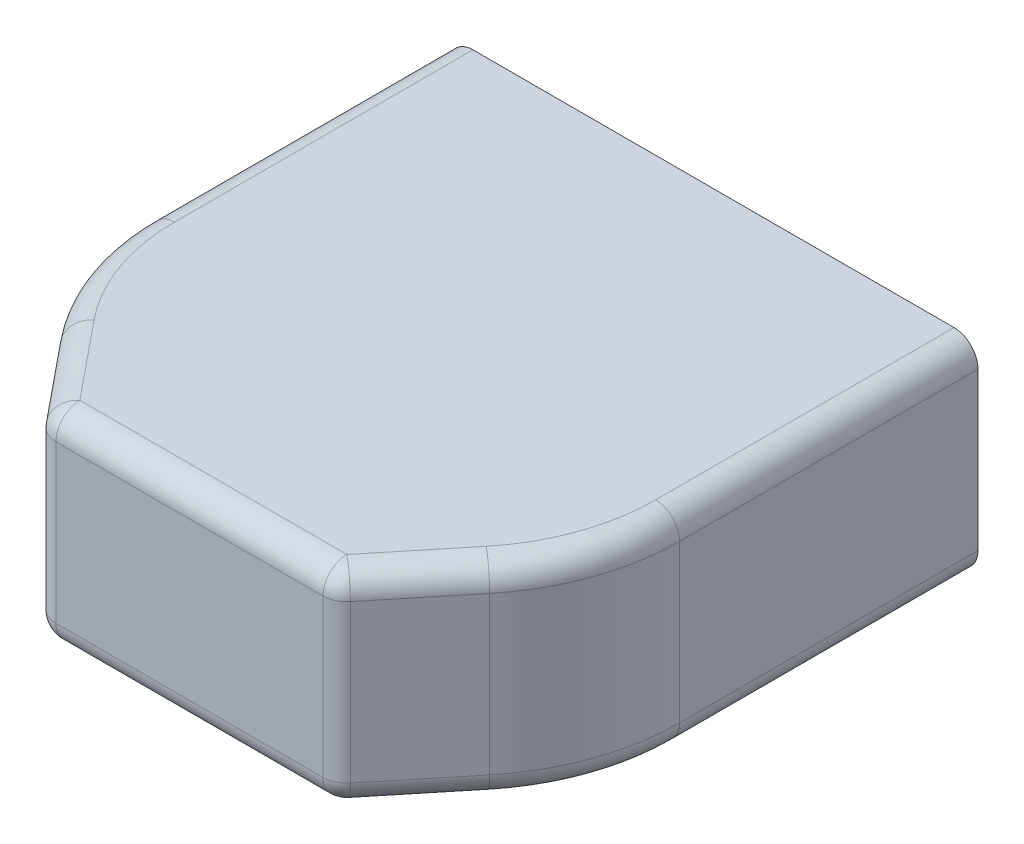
ISO-10303-21;
HEADER;
FILE_DESCRIPTION(('STEP AP214'),'2;1');
FILE_NAME('part.step','',(''),(''),'','','');
FILE_SCHEMA(('AUTOMOTIVE_DESIGN { 1 0 10303 214 1 1 1 1 }'));
ENDSEC;
DATA;
#1=APPLICATION_CONTEXT('core data for automotive mechanical design processes');
#2=APPLICATION_PROTOCOL_DEFINITION('international standard','automotive_design',2000,#1);
#3=PRODUCT_CONTEXT('',#1,'mechanical');
#4=PRODUCT('Part','Part','',(#3));
#5=PRODUCT_RELATED_PRODUCT_CATEGORY('part','',(#4));
#6=PRODUCT_DEFINITION_FORMATION('','',#4);
#7=PRODUCT_DEFINITION_CONTEXT('part definition',#1,'design');
#8=PRODUCT_DEFINITION('design','',#6,#7);
#9=PRODUCT_DEFINITION_SHAPE('','',#8);
#10=(LENGTH_UNIT() NAMED_UNIT(*) SI_UNIT(.MILLI.,.METRE.));
#11=(NAMED_UNIT(*) PLANE_ANGLE_UNIT() SI_UNIT($,.RADIAN.));
#12=(NAMED_UNIT(*) SI_UNIT($,.STERADIAN.) SOLID_ANGLE_UNIT());
#13=UNCERTAINTY_MEASURE_WITH_UNIT(LENGTH_MEASURE(1.E-05),#10,'distance_accuracy_value','');
#14=(GEOMETRIC_REPRESENTATION_CONTEXT(3) GLOBAL_UNCERTAINTY_ASSIGNED_CONTEXT((#13)) GLOBAL_UNIT_ASSIGNED_CONTEXT((#10,
#11,#12)) REPRESENTATION_CONTEXT('',''));
#15=CARTESIAN_POINT('',(0.,0.,0.));
#16=DIRECTION('',(0.,0.,1.));
#17=DIRECTION('',(1.,0.,0.));
#18=AXIS2_PLACEMENT_3D('',#15,#16,#17);
#19=CARTESIAN_POINT('',(-112.142211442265,86.9416986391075,-222.1685321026));
#20=DIRECTION('',(0.,0.,1.));
#21=DIRECTION('',(1.,0.,0.));
#22=AXIS2_PLACEMENT_3D('',#19,#20,#21);
#23=PLANE('',#22);
#24=DIRECTION('',(-1.,0.,0.));
#25=VECTOR('',#24,1.);
#26=CARTESIAN_POINT('',(-112.142211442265,0.,-222.1685321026));
#27=LINE('',#26,#25);
#28=CARTESIAN_POINT('',(101.982211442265,0.,-222.1685321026));
#29=VERTEX_POINT('',#28);
#30=CARTESIAN_POINT('',(-101.982211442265,0.,-222.1685321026));
#31=VERTEX_POINT('',#30);
#32=EDGE_CURVE('E380',#29,#31,#27,.T.);
#33=ORIENTED_EDGE('',*,*,#32,.T.);
#34=CARTESIAN_POINT('',(-101.982211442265,10.16,-222.1685321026));
#35=DIRECTION('',(0.,0.,1.));
#36=DIRECTION('',(1.,0.,0.));
#37=AXIS2_PLACEMENT_3D('',#34,#35,#36);
#38=CIRCLE('',#37,10.16);
#39=CARTESIAN_POINT('',(-112.142211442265,10.16,-222.1685321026));
#40=VERTEX_POINT('',#39);
#41=EDGE_CURVE('E438',#31,#40,#38,.F.);
#42=ORIENTED_EDGE('',*,*,#41,.T.);
#43=DIRECTION('',(0.,-1.,0.));
#44=VECTOR('',#43,1.);
#45=CARTESIAN_POINT('',(-112.142211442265,86.9416986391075,-222.1685321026));
#46=LINE('',#45,#44);
#47=CARTESIAN_POINT('',(-112.142211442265,76.7816986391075,-222.1685321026));
#48=VERTEX_POINT('',#47);
#49=EDGE_CURVE('E386',#48,#40,#46,.T.);
#50=ORIENTED_EDGE('',*,*,#49,.F.);
#51=CARTESIAN_POINT('',(-101.982211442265,76.7816986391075,-222.1685321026));
#52=DIRECTION('',(0.,0.,1.));
#53=DIRECTION('',(1.,0.,0.));
#54=AXIS2_PLACEMENT_3D('',#51,#52,#53);
#55=CIRCLE('',#54,10.16);
#56=CARTESIAN_POINT('',(-101.982211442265,86.9416986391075,-222.1685321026));
#57=VERTEX_POINT('',#56);
#58=EDGE_CURVE('E432',#48,#57,#55,.F.);
#59=ORIENTED_EDGE('',*,*,#58,.T.);
#60=DIRECTION('',(-1.,0.,0.));
#61=VECTOR('',#60,1.);
#62=CARTESIAN_POINT('',(-112.142211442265,86.9416986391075,-222.1685321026));
#63=LINE('',#62,#61);
#64=CARTESIAN_POINT('',(101.982211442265,86.9416986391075,-222.1685321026));
#65=VERTEX_POINT('',#64);
#66=EDGE_CURVE('E376',#65,#57,#63,.T.);
#67=ORIENTED_EDGE('',*,*,#66,.F.);
#68=CARTESIAN_POINT('',(101.982211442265,76.7816986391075,-222.1685321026));
#69=DIRECTION('',(0.,0.,1.));
#70=DIRECTION('',(1.,0.,0.));
#71=AXIS2_PLACEMENT_3D('',#68,#69,#70);
#72=CIRCLE('',#71,10.16);
#73=CARTESIAN_POINT('',(112.142211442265,76.7816986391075,-222.1685321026));
#74=VERTEX_POINT('',#73);
#75=EDGE_CURVE('E436',#65,#74,#72,.F.);
#76=ORIENTED_EDGE('',*,*,#75,.T.);
#77=DIRECTION('',(0.,-1.,0.));
#78=VECTOR('',#77,1.);
#79=CARTESIAN_POINT('',(112.142211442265,86.9416986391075,-222.1685321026));
#80=LINE('',#79,#78);
#81=CARTESIAN_POINT('',(112.142211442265,10.16,-222.1685321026));
#82=VERTEX_POINT('',#81);
#83=EDGE_CURVE('E379',#74,#82,#80,.T.);
#84=ORIENTED_EDGE('',*,*,#83,.T.);
#85=CARTESIAN_POINT('',(101.982211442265,10.16,-222.1685321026));
#86=DIRECTION('',(0.,0.,1.));
#87=DIRECTION('',(1.,0.,0.));
#88=AXIS2_PLACEMENT_3D('',#85,#86,#87);
#89=CIRCLE('',#88,10.16);
#90=EDGE_CURVE('E434',#82,#29,#89,.F.);
#91=ORIENTED_EDGE('',*,*,#90,.T.);
#92=EDGE_LOOP('',(#33,#42,#50,#59,#67,#76,#84,#91));
#93=FACE_BOUND('',#92,.T.);
#94=DIRECTION('',(-1.,0.,0.));
#95=VECTOR('',#94,1.);
#96=CARTESIAN_POINT('',(-112.142211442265,5.66338313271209,-222.1685321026));
#97=LINE('',#96,#95);
#98=CARTESIAN_POINT('',(101.982211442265,5.66338313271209,-222.1685321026));
#99=VERTEX_POINT('',#98);
#100=CARTESIAN_POINT('',(-101.982211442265,5.66338313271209,-222.1685321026));
#101=VERTEX_POINT('',#100);
#102=EDGE_CURVE('E366',#99,#101,#97,.T.);
#103=ORIENTED_EDGE('',*,*,#102,.F.);
#104=CARTESIAN_POINT('',(101.982211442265,10.16,-222.1685321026));
#105=DIRECTION('',(0.,0.,1.));
#106=DIRECTION('',(1.,0.,0.));
#107=AXIS2_PLACEMENT_3D('',#104,#105,#106);
#108=CIRCLE('',#107,4.4966168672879);
#109=CARTESIAN_POINT('',(106.478828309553,10.16,-222.1685321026));
#110=VERTEX_POINT('',#109);
#111=EDGE_CURVE('E361',#110,#99,#108,.F.);
#112=ORIENTED_EDGE('',*,*,#111,.F.);
#113=DIRECTION('',(0.,-1.,0.));
#114=VECTOR('',#113,1.);
#115=CARTESIAN_POINT('',(106.478828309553,86.9416986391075,-222.1685321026));
#116=LINE('',#115,#114);
#117=CARTESIAN_POINT('',(106.478828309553,76.7816986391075,-222.1685321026));
#118=VERTEX_POINT('',#117);
#119=EDGE_CURVE('E50',#118,#110,#116,.T.);
#120=ORIENTED_EDGE('',*,*,#119,.F.);
#121=CARTESIAN_POINT('',(101.982211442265,76.7816986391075,-222.1685321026));
#122=DIRECTION('',(0.,0.,1.));
#123=DIRECTION('',(1.,0.,0.));
#124=AXIS2_PLACEMENT_3D('',#121,#122,#123);
#125=CIRCLE('',#124,4.4966168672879);
#126=CARTESIAN_POINT('',(101.982211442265,81.2783155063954,-222.1685321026));
#127=VERTEX_POINT('',#126);
#128=EDGE_CURVE('E367',#127,#118,#125,.F.);
#129=ORIENTED_EDGE('',*,*,#128,.F.);
#130=DIRECTION('',(-1.,0.,0.));
#131=VECTOR('',#130,1.);
#132=CARTESIAN_POINT('',(-112.142211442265,81.2783155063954,-222.1685321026));
#133=LINE('',#132,#131);
#134=CARTESIAN_POINT('',(-101.982211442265,81.2783155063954,-222.1685321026));
#135=VERTEX_POINT('',#134);
#136=EDGE_CURVE('E363',#127,#135,#133,.T.);
#137=ORIENTED_EDGE('',*,*,#136,.T.);
#138=CARTESIAN_POINT('',(-101.982211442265,76.7816986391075,-222.1685321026));
#139=DIRECTION('',(0.,0.,1.));
#140=DIRECTION('',(1.,0.,0.));
#141=AXIS2_PLACEMENT_3D('',#138,#139,#140);
#142=CIRCLE('',#141,4.4966168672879);
#143=CARTESIAN_POINT('',(-106.478828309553,76.7816986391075,-222.1685321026));
#144=VERTEX_POINT('',#143);
#145=EDGE_CURVE('E359',#144,#135,#142,.F.);
#146=ORIENTED_EDGE('',*,*,#145,.F.);
#147=DIRECTION('',(0.,-1.,0.));
#148=VECTOR('',#147,1.);
#149=CARTESIAN_POINT('',(-106.478828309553,86.9416986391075,-222.1685321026));
#150=LINE('',#149,#148);
#151=CARTESIAN_POINT('',(-106.478828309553,10.16,-222.1685321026));
#152=VERTEX_POINT('',#151);
#153=EDGE_CURVE('E355',#144,#152,#150,.T.);
#154=ORIENTED_EDGE('',*,*,#153,.T.);
#155=CARTESIAN_POINT('',(-101.982211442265,10.16,-222.1685321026));
#156=DIRECTION('',(0.,0.,1.));
#157=DIRECTION('',(1.,0.,0.));
#158=AXIS2_PLACEMENT_3D('',#155,#156,#157);
#159=CIRCLE('',#158,4.4966168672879);
#160=EDGE_CURVE('E369',#101,#152,#159,.F.);
#161=ORIENTED_EDGE('',*,*,#160,.F.);
#162=EDGE_LOOP('',(#103,#112,#120,#129,#137,#146,#154,#161));
#163=FACE_BOUND('',#162,.T.);
#164=ADVANCED_FACE('F33',(#93,#163),#23,.F.);
#165=CARTESIAN_POINT('',(-112.142211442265,86.9416986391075,-62.2071889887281));
#166=DIRECTION('',(1.,0.,0.));
#167=DIRECTION('',(0.,0.,-1.));
#168=AXIS2_PLACEMENT_3D('',#165,#166,#167);
#169=PLANE('',#168);
#170=ORIENTED_EDGE('',*,*,#49,.T.);
#171=DIRECTION('',(0.,0.,1.));
#172=VECTOR('',#171,1.);
#173=CARTESIAN_POINT('',(-112.142211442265,10.16,-62.2071889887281));
#174=LINE('',#173,#172);
#175=CARTESIAN_POINT('',(-112.142211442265,10.16,-95.6656528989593));
#176=VERTEX_POINT('',#175);
#177=EDGE_CURVE('E415',#40,#176,#174,.T.);
#178=ORIENTED_EDGE('',*,*,#177,.T.);
#179=DIRECTION('',(0.,-1.,0.));
#180=VECTOR('',#179,1.);
#181=CARTESIAN_POINT('',(-112.142211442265,86.9416986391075,-95.6656528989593));
#182=LINE('',#181,#180);
#183=CARTESIAN_POINT('',(-112.142211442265,76.7816986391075,-95.6656528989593));
#184=VERTEX_POINT('',#183);
#185=EDGE_CURVE('E398',#176,#184,#182,.F.);
#186=ORIENTED_EDGE('',*,*,#185,.T.);
#187=DIRECTION('',(0.,0.,1.));
#188=VECTOR('',#187,1.);
#189=CARTESIAN_POINT('',(-112.142211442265,76.7816986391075,-222.1685321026));
#190=LINE('',#189,#188);
#191=EDGE_CURVE('E413',#184,#48,#190,.F.);
#192=ORIENTED_EDGE('',*,*,#191,.T.);
#193=EDGE_LOOP('',(#170,#178,#186,#192));
#194=FACE_BOUND('',#193,.T.);
#195=ADVANCED_FACE('F540',(#194),#169,.F.);
#196=CARTESIAN_POINT('',(-61.4196074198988,86.9416986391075,0.));
#197=DIRECTION('',(0.775019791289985,0.,-0.631936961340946));
#198=DIRECTION('',(-0.631936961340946,0.,-0.775019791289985));
#199=AXIS2_PLACEMENT_3D('',#196,#197,#198);
#200=PLANE('',#199);
#201=DIRECTION('',(0.,-1.,0.));
#202=VECTOR('',#201,1.);
#203=CARTESIAN_POINT('',(-90.9985714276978,86.9416986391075,-36.2762172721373));
#204=LINE('',#203,#202);
#205=CARTESIAN_POINT('',(-90.9985714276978,76.7816986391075,-36.2762172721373));
#206=VERTEX_POINT('',#205);
#207=CARTESIAN_POINT('',(-90.9985714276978,10.16,-36.2762172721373));
#208=VERTEX_POINT('',#207);
#209=EDGE_CURVE('E395',#206,#208,#204,.T.);
#210=ORIENTED_EDGE('',*,*,#209,.T.);
#211=DIRECTION('',(0.631936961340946,0.,0.775019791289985));
#212=VECTOR('',#211,1.);
#213=CARTESIAN_POINT('',(-61.4196074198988,10.16,0.));
#214=LINE('',#213,#212);
#215=CARTESIAN_POINT('',(-64.4687440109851,10.16,-3.73952047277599));
#216=VERTEX_POINT('',#215);
#217=EDGE_CURVE('E446',#208,#216,#214,.T.);
#218=ORIENTED_EDGE('',*,*,#217,.T.);
#219=DIRECTION('',(0.,-1.,0.));
#220=VECTOR('',#219,1.);
#221=CARTESIAN_POINT('',(-64.4687440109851,86.9416986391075,-3.73952047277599));
#222=LINE('',#221,#220);
#223=CARTESIAN_POINT('',(-64.4687440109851,76.7816986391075,-3.73952047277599));
#224=VERTEX_POINT('',#223);
#225=EDGE_CURVE('E407',#216,#224,#222,.F.);
#226=ORIENTED_EDGE('',*,*,#225,.T.);
#227=DIRECTION('',(0.631936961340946,0.,0.775019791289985));
#228=VECTOR('',#227,1.);
#229=CARTESIAN_POINT('',(-90.9985714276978,76.7816986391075,-36.2762172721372));
#230=LINE('',#229,#228);
#231=EDGE_CURVE('E444',#224,#206,#230,.F.);
#232=ORIENTED_EDGE('',*,*,#231,.T.);
#233=EDGE_LOOP('',(#210,#218,#226,#232));
#234=FACE_BOUND('',#233,.T.);
#235=ADVANCED_FACE('F558',(#234),#200,.F.);
#236=CARTESIAN_POINT('',(61.4196074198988,86.9416986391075,0.));
#237=DIRECTION('',(0.,0.,-1.));
#238=DIRECTION('',(-1.,0.,0.));
#239=AXIS2_PLACEMENT_3D('',#236,#237,#238);
#240=PLANE('',#239);
#241=DIRECTION('',(0.,-1.,0.));
#242=VECTOR('',#241,1.);
#243=CARTESIAN_POINT('',(-56.5945429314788,86.9416986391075,0.));
#244=LINE('',#243,#242);
#245=CARTESIAN_POINT('',(-56.5945429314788,76.7816986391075,0.));
#246=VERTEX_POINT('',#245);
#247=CARTESIAN_POINT('',(-56.5945429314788,10.16,0.));
#248=VERTEX_POINT('',#247);
#249=EDGE_CURVE('E404',#246,#248,#244,.T.);
#250=ORIENTED_EDGE('',*,*,#249,.T.);
#251=DIRECTION('',(1.,0.,0.));
#252=VECTOR('',#251,1.);
#253=CARTESIAN_POINT('',(61.4196074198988,10.16,0.));
#254=LINE('',#253,#252);
#255=CARTESIAN_POINT('',(56.5945429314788,10.16,0.));
#256=VERTEX_POINT('',#255);
#257=EDGE_CURVE('E454',#248,#256,#254,.T.);
#258=ORIENTED_EDGE('',*,*,#257,.T.);
#259=DIRECTION('',(0.,-1.,0.));
#260=VECTOR('',#259,1.);
#261=CARTESIAN_POINT('',(56.5945429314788,86.9416986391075,0.));
#262=LINE('',#261,#260);
#263=CARTESIAN_POINT('',(56.5945429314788,76.7816986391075,0.));
#264=VERTEX_POINT('',#263);
#265=EDGE_CURVE('E401',#256,#264,#262,.F.);
#266=ORIENTED_EDGE('',*,*,#265,.T.);
#267=DIRECTION('',(1.,0.,0.));
#268=VECTOR('',#267,1.);
#269=CARTESIAN_POINT('',(-56.5945429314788,76.7816986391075,0.));
#270=LINE('',#269,#268);
#271=EDGE_CURVE('E452',#264,#246,#270,.F.);
#272=ORIENTED_EDGE('',*,*,#271,.T.);
#273=EDGE_LOOP('',(#250,#258,#266,#272));
#274=FACE_BOUND('',#273,.T.);
#275=ADVANCED_FACE('F585',(#274),#240,.F.);
#276=CARTESIAN_POINT('',(61.4196074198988,86.9416986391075,0.));
#277=DIRECTION('',(-0.775019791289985,0.,-0.631936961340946));
#278=DIRECTION('',(-0.631936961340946,0.,0.775019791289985));
#279=AXIS2_PLACEMENT_3D('',#276,#277,#278);
#280=PLANE('',#279);
#281=DIRECTION('',(0.,-1.,0.));
#282=VECTOR('',#281,1.);
#283=CARTESIAN_POINT('',(64.468744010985,86.9416986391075,-3.73952047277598));
#284=LINE('',#283,#282);
#285=CARTESIAN_POINT('',(64.468744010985,76.7816986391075,-3.73952047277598));
#286=VERTEX_POINT('',#285);
#287=CARTESIAN_POINT('',(64.468744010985,10.16,-3.73952047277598));
#288=VERTEX_POINT('',#287);
#289=EDGE_CURVE('E410',#286,#288,#284,.T.);
#290=ORIENTED_EDGE('',*,*,#289,.T.);
#291=DIRECTION('',(0.631936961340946,0.,-0.775019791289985));
#292=VECTOR('',#291,1.);
#293=CARTESIAN_POINT('',(61.4196074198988,10.16,0.));
#294=LINE('',#293,#292);
#295=CARTESIAN_POINT('',(90.9985714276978,10.16,-36.2762172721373));
#296=VERTEX_POINT('',#295);
#297=EDGE_CURVE('E462',#288,#296,#294,.T.);
#298=ORIENTED_EDGE('',*,*,#297,.T.);
#299=DIRECTION('',(0.,-1.,0.));
#300=VECTOR('',#299,1.);
#301=CARTESIAN_POINT('',(90.9985714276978,86.9416986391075,-36.2762172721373));
#302=LINE('',#301,#300);
#303=CARTESIAN_POINT('',(90.9985714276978,76.7816986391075,-36.2762172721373));
#304=VERTEX_POINT('',#303);
#305=EDGE_CURVE('E392',#296,#304,#302,.F.);
#306=ORIENTED_EDGE('',*,*,#305,.T.);
#307=DIRECTION('',(0.631936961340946,0.,-0.775019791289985));
#308=VECTOR('',#307,1.);
#309=CARTESIAN_POINT('',(64.468744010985,76.7816986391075,-3.73952047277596));
#310=LINE('',#309,#308);
#311=EDGE_CURVE('E460',#304,#286,#310,.F.);
#312=ORIENTED_EDGE('',*,*,#311,.T.);
#313=EDGE_LOOP('',(#290,#298,#306,#312));
#314=FACE_BOUND('',#313,.T.);
#315=ADVANCED_FACE('F1110',(#314),#280,.F.);
#316=CARTESIAN_POINT('',(112.142211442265,86.9416986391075,-62.2071889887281));
#317=DIRECTION('',(-1.,0.,0.));
#318=DIRECTION('',(0.,0.,1.));
#319=AXIS2_PLACEMENT_3D('',#316,#317,#318);
#320=PLANE('',#319);
#321=ORIENTED_EDGE('',*,*,#83,.F.);
#322=DIRECTION('',(0.,0.,-1.));
#323=VECTOR('',#322,1.);
#324=CARTESIAN_POINT('',(112.142211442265,76.7816986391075,-95.6656528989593));
#325=LINE('',#324,#323);
#326=CARTESIAN_POINT('',(112.142211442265,76.7816986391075,-95.6656528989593));
#327=VERTEX_POINT('',#326);
#328=EDGE_CURVE('E11',#74,#327,#325,.F.);
#329=ORIENTED_EDGE('',*,*,#328,.T.);
#330=DIRECTION('',(0.,-1.,0.));
#331=VECTOR('',#330,1.);
#332=CARTESIAN_POINT('',(112.142211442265,86.9416986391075,-95.6656528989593));
#333=LINE('',#332,#331);
#334=CARTESIAN_POINT('',(112.142211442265,10.16,-95.6656528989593));
#335=VERTEX_POINT('',#334);
#336=EDGE_CURVE('E389',#327,#335,#333,.T.);
#337=ORIENTED_EDGE('',*,*,#336,.T.);
#338=DIRECTION('',(0.,0.,-1.));
#339=VECTOR('',#338,1.);
#340=CARTESIAN_POINT('',(112.142211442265,10.16,-62.2071889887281));
#341=LINE('',#340,#339);
#342=EDGE_CURVE('E42',#335,#82,#341,.T.);
#343=ORIENTED_EDGE('',*,*,#342,.T.);
#344=EDGE_LOOP('',(#321,#329,#337,#343));
#345=FACE_BOUND('',#344,.T.);
#346=ADVANCED_FACE('F1102',(#345),#320,.F.);
#347=CARTESIAN_POINT('',(112.142211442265,86.9416986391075,-222.1685321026));
#348=DIRECTION('',(0.,1.,0.));
#349=DIRECTION('',(0.,0.,1.));
#350=AXIS2_PLACEMENT_3D('',#347,#348,#349);
#351=PLANE('',#350);
#352=CARTESIAN_POINT('',(18.162211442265,86.9416986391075,-95.6656528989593));
#353=DIRECTION('',(0.,1.,0.));
#354=DIRECTION('',(0.,0.,1.));
#355=AXIS2_PLACEMENT_3D('',#352,#353,#354);
#356=CIRCLE('',#355,83.82);
#357=CARTESIAN_POINT('',(83.1243703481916,86.9416986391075,-42.6966967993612));
#358=VERTEX_POINT('',#357);
#359=CARTESIAN_POINT('',(101.982211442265,86.9416986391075,-95.6656528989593));
#360=VERTEX_POINT('',#359);
#361=EDGE_CURVE('E58',#358,#360,#356,.T.);
#362=ORIENTED_EDGE('',*,*,#361,.T.);
#363=DIRECTION('',(0.,0.,-1.));
#364=VECTOR('',#363,1.);
#365=CARTESIAN_POINT('',(101.982211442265,86.9416986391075,-222.1685321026));
#366=LINE('',#365,#364);
#367=EDGE_CURVE('E479',#360,#65,#366,.T.);
#368=ORIENTED_EDGE('',*,*,#367,.T.);
#369=ORIENTED_EDGE('',*,*,#66,.T.);
#370=DIRECTION('',(0.,0.,1.));
#371=VECTOR('',#370,1.);
#372=CARTESIAN_POINT('',(-101.982211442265,86.9416986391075,-95.6656528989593));
#373=LINE('',#372,#371);
#374=CARTESIAN_POINT('',(-101.982211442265,86.9416986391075,-95.6656528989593));
#375=VERTEX_POINT('',#374);
#376=EDGE_CURVE('E468',#57,#375,#373,.T.);
#377=ORIENTED_EDGE('',*,*,#376,.T.);
#378=CARTESIAN_POINT('',(-18.162211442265,86.9416986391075,-95.6656528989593));
#379=DIRECTION('',(0.,1.,0.));
#380=DIRECTION('',(0.,0.,1.));
#381=AXIS2_PLACEMENT_3D('',#378,#379,#380);
#382=CIRCLE('',#381,83.82);
#383=CARTESIAN_POINT('',(-83.1243703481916,86.9416986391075,-42.6966967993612));
#384=VERTEX_POINT('',#383);
#385=EDGE_CURVE('E470',#375,#384,#382,.T.);
#386=ORIENTED_EDGE('',*,*,#385,.T.);
#387=DIRECTION('',(0.631936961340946,0.,0.775019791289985));
#388=VECTOR('',#387,1.);
#389=CARTESIAN_POINT('',(-56.5945429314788,86.9416986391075,-10.16));
#390=LINE('',#389,#388);
#391=CARTESIAN_POINT('',(-56.5945429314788,86.9416986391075,-10.16));
#392=VERTEX_POINT('',#391);
#393=EDGE_CURVE('E472',#384,#392,#390,.T.);
#394=ORIENTED_EDGE('',*,*,#393,.T.);
#395=DIRECTION('',(1.,0.,0.));
#396=VECTOR('',#395,1.);
#397=CARTESIAN_POINT('',(56.5945429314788,86.9416986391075,-10.16));
#398=LINE('',#397,#396);
#399=CARTESIAN_POINT('',(56.5945429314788,86.9416986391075,-10.16));
#400=VERTEX_POINT('',#399);
#401=EDGE_CURVE('E474',#392,#400,#398,.T.);
#402=ORIENTED_EDGE('',*,*,#401,.T.);
#403=DIRECTION('',(0.631936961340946,0.,-0.775019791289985));
#404=VECTOR('',#403,1.);
#405=CARTESIAN_POINT('',(83.1243703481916,86.9416986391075,-42.6966967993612));
#406=LINE('',#405,#404);
#407=EDGE_CURVE('E476',#400,#358,#406,.T.);
#408=ORIENTED_EDGE('',*,*,#407,.T.);
#409=EDGE_LOOP('',(#362,#368,#369,#377,#386,#394,#402,#408));
#410=FACE_BOUND('',#409,.T.);
#411=ADVANCED_FACE('F602',(#410),#351,.T.);
#412=CARTESIAN_POINT('',(112.142211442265,0.,-222.1685321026));
#413=DIRECTION('',(0.,1.,0.));
#414=DIRECTION('',(0.,0.,1.));
#415=AXIS2_PLACEMENT_3D('',#412,#413,#414);
#416=PLANE('',#415);
#417=CARTESIAN_POINT('',(-18.162211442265,0.,-95.6656528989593));
#418=DIRECTION('',(0.,1.,0.));
#419=DIRECTION('',(0.,0.,1.));
#420=AXIS2_PLACEMENT_3D('',#417,#418,#419);
#421=CIRCLE('',#420,83.82);
#422=CARTESIAN_POINT('',(-83.1243703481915,0.,-42.6966967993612));
#423=VERTEX_POINT('',#422);
#424=CARTESIAN_POINT('',(-101.982211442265,0.,-95.6656528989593));
#425=VERTEX_POINT('',#424);
#426=EDGE_CURVE('E428',#423,#425,#421,.F.);
#427=ORIENTED_EDGE('',*,*,#426,.T.);
#428=DIRECTION('',(0.,0.,1.));
#429=VECTOR('',#428,1.);
#430=CARTESIAN_POINT('',(-101.982211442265,0.,-222.1685321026));
#431=LINE('',#430,#429);
#432=EDGE_CURVE('E430',#425,#31,#431,.F.);
#433=ORIENTED_EDGE('',*,*,#432,.T.);
#434=ORIENTED_EDGE('',*,*,#32,.F.);
#435=DIRECTION('',(0.,0.,-1.));
#436=VECTOR('',#435,1.);
#437=CARTESIAN_POINT('',(101.982211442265,0.,-222.1685321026));
#438=LINE('',#437,#436);
#439=CARTESIAN_POINT('',(101.982211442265,0.,-95.6656528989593));
#440=VERTEX_POINT('',#439);
#441=EDGE_CURVE('E418',#29,#440,#438,.F.);
#442=ORIENTED_EDGE('',*,*,#441,.T.);
#443=CARTESIAN_POINT('',(18.162211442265,0.,-95.6656528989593));
#444=DIRECTION('',(0.,1.,0.));
#445=DIRECTION('',(0.,0.,1.));
#446=AXIS2_PLACEMENT_3D('',#443,#444,#445);
#447=CIRCLE('',#446,83.82);
#448=CARTESIAN_POINT('',(83.1243703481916,0.,-42.6966967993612));
#449=VERTEX_POINT('',#448);
#450=EDGE_CURVE('E420',#440,#449,#447,.F.);
#451=ORIENTED_EDGE('',*,*,#450,.T.);
#452=DIRECTION('',(0.631936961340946,0.,-0.775019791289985));
#453=VECTOR('',#452,1.);
#454=CARTESIAN_POINT('',(182.61126192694,0.,-164.709357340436));
#455=LINE('',#454,#453);
#456=CARTESIAN_POINT('',(56.5945429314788,0.,-10.16));
#457=VERTEX_POINT('',#456);
#458=EDGE_CURVE('E422',#449,#457,#455,.F.);
#459=ORIENTED_EDGE('',*,*,#458,.T.);
#460=DIRECTION('',(1.,0.,0.));
#461=VECTOR('',#460,1.);
#462=CARTESIAN_POINT('',(112.142211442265,0.,-10.16));
#463=LINE('',#462,#461);
#464=CARTESIAN_POINT('',(-56.5945429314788,0.,-10.16));
#465=VERTEX_POINT('',#464);
#466=EDGE_CURVE('E424',#457,#465,#463,.F.);
#467=ORIENTED_EDGE('',*,*,#466,.T.);
#468=DIRECTION('',(0.631936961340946,0.,0.775019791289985));
#469=VECTOR('',#468,1.);
#470=CARTESIAN_POINT('',(-93.0445508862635,0.,-54.8629993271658));
#471=LINE('',#470,#469);
#472=EDGE_CURVE('E426',#465,#423,#471,.F.);
#473=ORIENTED_EDGE('',*,*,#472,.T.);
#474=EDGE_LOOP('',(#427,#433,#434,#442,#451,#459,#467,#473));
#475=FACE_BOUND('',#474,.T.);
#476=ADVANCED_FACE('F569',(#475),#416,.F.);
#477=CARTESIAN_POINT('',(18.162211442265,86.9416986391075,-95.6656528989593));
#478=DIRECTION('',(0.,-1.,0.));
#479=DIRECTION('',(0.,0.,-1.));
#480=AXIS2_PLACEMENT_3D('',#477,#478,#479);
#481=CYLINDRICAL_SURFACE('',#480,93.98);
#482=ORIENTED_EDGE('',*,*,#305,.F.);
#483=CARTESIAN_POINT('',(18.162211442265,10.16,-95.6656528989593));
#484=DIRECTION('',(0.,1.,0.));
#485=DIRECTION('',(0.,0.,1.));
#486=AXIS2_PLACEMENT_3D('',#483,#484,#485);
#487=CIRCLE('',#486,93.98);
#488=EDGE_CURVE('E466',#296,#335,#487,.T.);
#489=ORIENTED_EDGE('',*,*,#488,.T.);
#490=ORIENTED_EDGE('',*,*,#336,.F.);
#491=CARTESIAN_POINT('',(18.162211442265,76.7816986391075,-95.6656528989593));
#492=DIRECTION('',(0.,1.,0.));
#493=DIRECTION('',(0.,0.,1.));
#494=AXIS2_PLACEMENT_3D('',#491,#492,#493);
#495=CIRCLE('',#494,93.98);
#496=EDGE_CURVE('E464',#327,#304,#495,.F.);
#497=ORIENTED_EDGE('',*,*,#496,.T.);
#498=EDGE_LOOP('',(#482,#489,#490,#497));
#499=FACE_BOUND('',#498,.T.);
#500=ADVANCED_FACE('F623',(#499),#481,.T.);
#501=CARTESIAN_POINT('',(-18.162211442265,86.9416986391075,-95.6656528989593));
#502=DIRECTION('',(0.,-1.,0.));
#503=DIRECTION('',(0.,0.,-1.));
#504=AXIS2_PLACEMENT_3D('',#501,#502,#503);
#505=CYLINDRICAL_SURFACE('',#504,93.98);
#506=ORIENTED_EDGE('',*,*,#185,.F.);
#507=CARTESIAN_POINT('',(-18.162211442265,10.16,-95.6656528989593));
#508=DIRECTION('',(0.,1.,0.));
#509=DIRECTION('',(0.,0.,1.));
#510=AXIS2_PLACEMENT_3D('',#507,#508,#509);
#511=CIRCLE('',#510,93.98);
#512=EDGE_CURVE('E442',#176,#208,#511,.T.);
#513=ORIENTED_EDGE('',*,*,#512,.T.);
#514=ORIENTED_EDGE('',*,*,#209,.F.);
#515=CARTESIAN_POINT('',(-18.162211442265,76.7816986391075,-95.6656528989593));
#516=DIRECTION('',(0.,1.,0.));
#517=DIRECTION('',(0.,0.,1.));
#518=AXIS2_PLACEMENT_3D('',#515,#516,#517);
#519=CIRCLE('',#518,93.98);
#520=EDGE_CURVE('E440',#206,#184,#519,.F.);
#521=ORIENTED_EDGE('',*,*,#520,.T.);
#522=EDGE_LOOP('',(#506,#513,#514,#521));
#523=FACE_BOUND('',#522,.T.);
#524=ADVANCED_FACE('F554',(#523),#505,.T.);
#525=CARTESIAN_POINT('',(-56.5945429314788,86.9416986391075,-10.16));
#526=DIRECTION('',(0.,-1.,0.));
#527=DIRECTION('',(0.,0.,-1.));
#528=AXIS2_PLACEMENT_3D('',#525,#526,#527);
#529=CYLINDRICAL_SURFACE('',#528,10.16);
#530=ORIENTED_EDGE('',*,*,#225,.F.);
#531=CARTESIAN_POINT('',(-56.5945429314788,10.16,-10.16));
#532=DIRECTION('',(0.,-1.,0.));
#533=DIRECTION('',(0.,0.,-1.));
#534=AXIS2_PLACEMENT_3D('',#531,#532,#533);
#535=CIRCLE('',#534,10.16);
#536=EDGE_CURVE('E450',#216,#248,#535,.F.);
#537=ORIENTED_EDGE('',*,*,#536,.T.);
#538=ORIENTED_EDGE('',*,*,#249,.F.);
#539=CARTESIAN_POINT('',(-56.5945429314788,76.7816986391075,-10.16));
#540=DIRECTION('',(0.,-1.,0.));
#541=DIRECTION('',(0.,0.,-1.));
#542=AXIS2_PLACEMENT_3D('',#539,#540,#541);
#543=CIRCLE('',#542,10.16);
#544=EDGE_CURVE('E448',#246,#224,#543,.T.);
#545=ORIENTED_EDGE('',*,*,#544,.T.);
#546=EDGE_LOOP('',(#530,#537,#538,#545));
#547=FACE_BOUND('',#546,.T.);
#548=ADVANCED_FACE('F582',(#547),#529,.T.);
#549=CARTESIAN_POINT('',(56.5945429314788,86.9416986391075,-10.16));
#550=DIRECTION('',(0.,-1.,0.));
#551=DIRECTION('',(0.,0.,-1.));
#552=AXIS2_PLACEMENT_3D('',#549,#550,#551);
#553=CYLINDRICAL_SURFACE('',#552,10.16);
#554=ORIENTED_EDGE('',*,*,#265,.F.);
#555=CARTESIAN_POINT('',(56.5945429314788,10.16,-10.16));
#556=DIRECTION('',(0.,-1.,0.));
#557=DIRECTION('',(0.,0.,-1.));
#558=AXIS2_PLACEMENT_3D('',#555,#556,#557);
#559=CIRCLE('',#558,10.16);
#560=EDGE_CURVE('E458',#256,#288,#559,.F.);
#561=ORIENTED_EDGE('',*,*,#560,.T.);
#562=ORIENTED_EDGE('',*,*,#289,.F.);
#563=CARTESIAN_POINT('',(56.5945429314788,76.7816986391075,-10.16));
#564=DIRECTION('',(0.,-1.,0.));
#565=DIRECTION('',(0.,0.,-1.));
#566=AXIS2_PLACEMENT_3D('',#563,#564,#565);
#567=CIRCLE('',#566,10.16);
#568=EDGE_CURVE('E456',#286,#264,#567,.T.);
#569=ORIENTED_EDGE('',*,*,#568,.T.);
#570=EDGE_LOOP('',(#554,#561,#562,#569));
#571=FACE_BOUND('',#570,.T.);
#572=ADVANCED_FACE('F631',(#571),#553,.T.);
#573=CARTESIAN_POINT('',(101.982211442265,10.16,-62.2071889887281));
#574=DIRECTION('',(0.,0.,-1.));
#575=DIRECTION('',(-1.,0.,0.));
#576=AXIS2_PLACEMENT_3D('',#573,#574,#575);
#577=CYLINDRICAL_SURFACE('',#576,10.16);
#578=ORIENTED_EDGE('',*,*,#90,.F.);
#579=ORIENTED_EDGE('',*,*,#342,.F.);
#580=CARTESIAN_POINT('',(101.982211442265,10.16,-95.6656528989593));
#581=DIRECTION('',(0.,0.,1.));
#582=DIRECTION('',(1.,0.,0.));
#583=AXIS2_PLACEMENT_3D('',#580,#581,#582);
#584=CIRCLE('',#583,10.16);
#585=EDGE_CURVE('E383',#440,#335,#584,.T.);
#586=ORIENTED_EDGE('',*,*,#585,.F.);
#587=ORIENTED_EDGE('',*,*,#441,.F.);
#588=EDGE_LOOP('',(#578,#579,#586,#587));
#589=FACE_BOUND('',#588,.T.);
#590=ADVANCED_FACE('F634',(#589),#577,.T.);
#591=CARTESIAN_POINT('',(18.162211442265,10.16,-95.6656528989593));
#592=DIRECTION('',(0.,1.,0.));
#593=DIRECTION('',(0.,0.,1.));
#594=AXIS2_PLACEMENT_3D('',#591,#592,#593);
#595=TOROIDAL_SURFACE('',#594,83.82,10.16);
#596=ORIENTED_EDGE('',*,*,#585,.T.);
#597=ORIENTED_EDGE('',*,*,#488,.F.);
#598=CARTESIAN_POINT('',(83.1243703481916,10.16,-42.6966967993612));
#599=DIRECTION('',(-0.631936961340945,0.,0.775019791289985));
#600=DIRECTION('',(0.775019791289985,0.,0.631936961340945));
#601=AXIS2_PLACEMENT_3D('',#598,#599,#600);
#602=CIRCLE('',#601,10.16);
#603=EDGE_CURVE('E499',#449,#296,#602,.T.);
#604=ORIENTED_EDGE('',*,*,#603,.F.);
#605=ORIENTED_EDGE('',*,*,#450,.F.);
#606=EDGE_LOOP('',(#596,#597,#604,#605));
#607=FACE_BOUND('',#606,.T.);
#608=ADVANCED_FACE('F653',(#607),#595,.T.);
#609=CARTESIAN_POINT('',(53.5454063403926,10.16,-6.420479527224));
#610=DIRECTION('',(0.631936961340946,0.,-0.775019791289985));
#611=DIRECTION('',(-0.775019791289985,0.,-0.631936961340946));
#612=AXIS2_PLACEMENT_3D('',#609,#610,#611);
#613=CYLINDRICAL_SURFACE('',#612,10.16);
#614=ORIENTED_EDGE('',*,*,#603,.T.);
#615=ORIENTED_EDGE('',*,*,#297,.F.);
#616=CARTESIAN_POINT('',(56.5945429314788,10.16,-10.16));
#617=DIRECTION('',(-0.631936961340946,0.,0.775019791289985));
#618=DIRECTION('',(0.775019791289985,0.,0.631936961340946));
#619=AXIS2_PLACEMENT_3D('',#616,#617,#618);
#620=CIRCLE('',#619,10.16);
#621=EDGE_CURVE('E496',#457,#288,#620,.T.);
#622=ORIENTED_EDGE('',*,*,#621,.F.);
#623=ORIENTED_EDGE('',*,*,#458,.F.);
#624=EDGE_LOOP('',(#614,#615,#622,#623));
#625=FACE_BOUND('',#624,.T.);
#626=ADVANCED_FACE('F649',(#625),#613,.T.);
#627=CARTESIAN_POINT('',(56.5945429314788,10.16,-10.16));
#628=DIRECTION('',(0.,0.,1.));
#629=DIRECTION('',(1.,0.,0.));
#630=AXIS2_PLACEMENT_3D('',#627,#628,#629);
#631=SPHERICAL_SURFACE('',#630,10.16);
#632=ORIENTED_EDGE('',*,*,#621,.T.);
#633=ORIENTED_EDGE('',*,*,#560,.F.);
#634=CARTESIAN_POINT('',(56.5945429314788,10.16,-10.16));
#635=DIRECTION('',(-1.,0.,0.));
#636=DIRECTION('',(0.,0.,1.));
#637=AXIS2_PLACEMENT_3D('',#634,#635,#636);
#638=CIRCLE('',#637,10.16);
#639=EDGE_CURVE('E493',#457,#256,#638,.T.);
#640=ORIENTED_EDGE('',*,*,#639,.F.);
#641=EDGE_LOOP('',(#632,#633,#640));
#642=FACE_BOUND('',#641,.T.);
#643=ADVANCED_FACE('F646',(#642),#631,.T.);
#644=CARTESIAN_POINT('',(61.4196074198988,10.16,-10.16));
#645=DIRECTION('',(1.,0.,0.));
#646=DIRECTION('',(0.,0.,-1.));
#647=AXIS2_PLACEMENT_3D('',#644,#645,#646);
#648=CYLINDRICAL_SURFACE('',#647,10.16);
#649=ORIENTED_EDGE('',*,*,#639,.T.);
#650=ORIENTED_EDGE('',*,*,#257,.F.);
#651=CARTESIAN_POINT('',(-56.5945429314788,10.16,-10.16));
#652=DIRECTION('',(-1.,0.,0.));
#653=DIRECTION('',(0.,0.,1.));
#654=AXIS2_PLACEMENT_3D('',#651,#652,#653);
#655=CIRCLE('',#654,10.16);
#656=EDGE_CURVE('E490',#465,#248,#655,.T.);
#657=ORIENTED_EDGE('',*,*,#656,.F.);
#658=ORIENTED_EDGE('',*,*,#466,.F.);
#659=EDGE_LOOP('',(#649,#650,#657,#658));
#660=FACE_BOUND('',#659,.T.);
#661=ADVANCED_FACE('F576',(#660),#648,.T.);
#662=CARTESIAN_POINT('',(-56.5945429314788,10.16,-10.16));
#663=DIRECTION('',(0.,0.,1.));
#664=DIRECTION('',(1.,0.,0.));
#665=AXIS2_PLACEMENT_3D('',#662,#663,#664);
#666=SPHERICAL_SURFACE('',#665,10.16);
#667=ORIENTED_EDGE('',*,*,#656,.T.);
#668=ORIENTED_EDGE('',*,*,#536,.F.);
#669=CARTESIAN_POINT('',(-56.5945429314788,10.16,-10.16));
#670=DIRECTION('',(-0.631936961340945,0.,-0.775019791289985));
#671=DIRECTION('',(-0.775019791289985,0.,0.631936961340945));
#672=AXIS2_PLACEMENT_3D('',#669,#670,#671);
#673=CIRCLE('',#672,10.16);
#674=EDGE_CURVE('E487',#465,#216,#673,.T.);
#675=ORIENTED_EDGE('',*,*,#674,.F.);
#676=EDGE_LOOP('',(#667,#668,#675));
#677=FACE_BOUND('',#676,.T.);
#678=ADVANCED_FACE('F579',(#677),#666,.T.);
#679=CARTESIAN_POINT('',(-53.5454063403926,10.16,-6.420479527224));
#680=DIRECTION('',(0.631936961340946,0.,0.775019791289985));
#681=DIRECTION('',(0.775019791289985,0.,-0.631936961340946));
#682=AXIS2_PLACEMENT_3D('',#679,#680,#681);
#683=CYLINDRICAL_SURFACE('',#682,10.16);
#684=ORIENTED_EDGE('',*,*,#674,.T.);
#685=ORIENTED_EDGE('',*,*,#217,.F.);
#686=CARTESIAN_POINT('',(-83.1243703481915,10.16,-42.6966967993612));
#687=DIRECTION('',(-0.631936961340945,0.,-0.775019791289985));
#688=DIRECTION('',(-0.775019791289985,0.,0.631936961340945));
#689=AXIS2_PLACEMENT_3D('',#686,#687,#688);
#690=CIRCLE('',#689,10.16);
#691=EDGE_CURVE('E484',#423,#208,#690,.T.);
#692=ORIENTED_EDGE('',*,*,#691,.F.);
#693=ORIENTED_EDGE('',*,*,#472,.F.);
#694=EDGE_LOOP('',(#684,#685,#692,#693));
#695=FACE_BOUND('',#694,.T.);
#696=ADVANCED_FACE('F562',(#695),#683,.T.);
#697=CARTESIAN_POINT('',(-18.162211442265,10.16,-95.6656528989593));
#698=DIRECTION('',(0.,1.,0.));
#699=DIRECTION('',(0.,0.,1.));
#700=AXIS2_PLACEMENT_3D('',#697,#698,#699);
#701=TOROIDAL_SURFACE('',#700,83.82,10.16);
#702=ORIENTED_EDGE('',*,*,#691,.T.);
#703=ORIENTED_EDGE('',*,*,#512,.F.);
#704=CARTESIAN_POINT('',(-101.982211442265,10.16,-95.6656528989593));
#705=DIRECTION('',(0.,0.,-1.));
#706=DIRECTION('',(-1.,0.,0.));
#707=AXIS2_PLACEMENT_3D('',#704,#705,#706);
#708=CIRCLE('',#707,10.16);
#709=EDGE_CURVE('E482',#425,#176,#708,.T.);
#710=ORIENTED_EDGE('',*,*,#709,.F.);
#711=ORIENTED_EDGE('',*,*,#426,.F.);
#712=EDGE_LOOP('',(#702,#703,#710,#711));
#713=FACE_BOUND('',#712,.T.);
#714=ADVANCED_FACE('F567',(#713),#701,.T.);
#715=CARTESIAN_POINT('',(-101.982211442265,10.16,-62.2071889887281));
#716=DIRECTION('',(0.,0.,1.));
#717=DIRECTION('',(1.,0.,0.));
#718=AXIS2_PLACEMENT_3D('',#715,#716,#717);
#719=CYLINDRICAL_SURFACE('',#718,10.16);
#720=ORIENTED_EDGE('',*,*,#41,.F.);
#721=ORIENTED_EDGE('',*,*,#432,.F.);
#722=ORIENTED_EDGE('',*,*,#709,.T.);
#723=ORIENTED_EDGE('',*,*,#177,.F.);
#724=EDGE_LOOP('',(#720,#721,#722,#723));
#725=FACE_BOUND('',#724,.T.);
#726=ADVANCED_FACE('F550',(#725),#719,.T.);
#727=CARTESIAN_POINT('',(-101.982211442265,76.7816986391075,-222.1685321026));
#728=DIRECTION('',(0.,0.,-1.));
#729=DIRECTION('',(-1.,0.,0.));
#730=AXIS2_PLACEMENT_3D('',#727,#728,#729);
#731=CYLINDRICAL_SURFACE('',#730,10.16);
#732=ORIENTED_EDGE('',*,*,#58,.F.);
#733=ORIENTED_EDGE('',*,*,#191,.F.);
#734=CARTESIAN_POINT('',(-101.982211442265,76.7816986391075,-95.6656528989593));
#735=DIRECTION('',(0.,0.,1.));
#736=DIRECTION('',(1.,0.,0.));
#737=AXIS2_PLACEMENT_3D('',#734,#735,#736);
#738=CIRCLE('',#737,10.16);
#739=EDGE_CURVE('E37',#375,#184,#738,.T.);
#740=ORIENTED_EDGE('',*,*,#739,.F.);
#741=ORIENTED_EDGE('',*,*,#376,.F.);
#742=EDGE_LOOP('',(#732,#733,#740,#741));
#743=FACE_BOUND('',#742,.T.);
#744=ADVANCED_FACE('F35',(#743),#731,.T.);
#745=CARTESIAN_POINT('',(-18.162211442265,76.7816986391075,-95.6656528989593));
#746=DIRECTION('',(0.,1.,0.));
#747=DIRECTION('',(0.,0.,1.));
#748=AXIS2_PLACEMENT_3D('',#745,#746,#747);
#749=TOROIDAL_SURFACE('',#748,83.82,10.16);
#750=ORIENTED_EDGE('',*,*,#739,.T.);
#751=ORIENTED_EDGE('',*,*,#520,.F.);
#752=CARTESIAN_POINT('',(-83.1243703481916,76.7816986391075,-42.6966967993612));
#753=DIRECTION('',(0.631936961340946,0.,0.775019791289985));
#754=DIRECTION('',(0.775019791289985,0.,-0.631936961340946));
#755=AXIS2_PLACEMENT_3D('',#752,#753,#754);
#756=CIRCLE('',#755,10.16);
#757=EDGE_CURVE('E522',#384,#206,#756,.T.);
#758=ORIENTED_EDGE('',*,*,#757,.F.);
#759=ORIENTED_EDGE('',*,*,#385,.F.);
#760=EDGE_LOOP('',(#750,#751,#758,#759));
#761=FACE_BOUND('',#760,.T.);
#762=ADVANCED_FACE('F533',(#761),#749,.T.);
#763=CARTESIAN_POINT('',(-93.0445508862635,76.7816986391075,-54.8629993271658));
#764=DIRECTION('',(-0.631936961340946,0.,-0.775019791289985));
#765=DIRECTION('',(-0.775019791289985,0.,0.631936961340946));
#766=AXIS2_PLACEMENT_3D('',#763,#764,#765);
#767=CYLINDRICAL_SURFACE('',#766,10.16);
#768=ORIENTED_EDGE('',*,*,#757,.T.);
#769=ORIENTED_EDGE('',*,*,#231,.F.);
#770=CARTESIAN_POINT('',(-56.5945429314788,76.7816986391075,-10.16));
#771=DIRECTION('',(0.631936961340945,0.,0.775019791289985));
#772=DIRECTION('',(0.775019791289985,0.,-0.631936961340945));
#773=AXIS2_PLACEMENT_3D('',#770,#771,#772);
#774=CIRCLE('',#773,10.16);
#775=EDGE_CURVE('E520',#392,#224,#774,.T.);
#776=ORIENTED_EDGE('',*,*,#775,.F.);
#777=ORIENTED_EDGE('',*,*,#393,.F.);
#778=EDGE_LOOP('',(#768,#769,#776,#777));
#779=FACE_BOUND('',#778,.T.);
#780=ADVANCED_FACE('F604',(#779),#767,.T.);
#781=CARTESIAN_POINT('',(-56.5945429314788,76.7816986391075,-10.16));
#782=DIRECTION('',(0.,0.,1.));
#783=DIRECTION('',(1.,0.,0.));
#784=AXIS2_PLACEMENT_3D('',#781,#782,#783);
#785=SPHERICAL_SURFACE('',#784,10.16);
#786=ORIENTED_EDGE('',*,*,#775,.T.);
#787=ORIENTED_EDGE('',*,*,#544,.F.);
#788=CARTESIAN_POINT('',(-56.5945429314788,76.7816986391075,-10.16));
#789=DIRECTION('',(1.,0.,0.));
#790=DIRECTION('',(0.,0.,-1.));
#791=AXIS2_PLACEMENT_3D('',#788,#789,#790);
#792=CIRCLE('',#791,10.16);
#793=EDGE_CURVE('E517',#392,#246,#792,.T.);
#794=ORIENTED_EDGE('',*,*,#793,.F.);
#795=EDGE_LOOP('',(#786,#787,#794));
#796=FACE_BOUND('',#795,.T.);
#797=ADVANCED_FACE('F606',(#796),#785,.T.);
#798=CARTESIAN_POINT('',(112.142211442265,76.7816986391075,-10.16));
#799=DIRECTION('',(-1.,0.,0.));
#800=DIRECTION('',(0.,0.,1.));
#801=AXIS2_PLACEMENT_3D('',#798,#799,#800);
#802=CYLINDRICAL_SURFACE('',#801,10.16);
#803=ORIENTED_EDGE('',*,*,#793,.T.);
#804=ORIENTED_EDGE('',*,*,#271,.F.);
#805=CARTESIAN_POINT('',(56.5945429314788,76.7816986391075,-10.16));
#806=DIRECTION('',(1.,0.,0.));
#807=DIRECTION('',(0.,0.,-1.));
#808=AXIS2_PLACEMENT_3D('',#805,#806,#807);
#809=CIRCLE('',#808,10.16);
#810=EDGE_CURVE('E514',#400,#264,#809,.T.);
#811=ORIENTED_EDGE('',*,*,#810,.F.);
#812=ORIENTED_EDGE('',*,*,#401,.F.);
#813=EDGE_LOOP('',(#803,#804,#811,#812));
#814=FACE_BOUND('',#813,.T.);
#815=ADVANCED_FACE('F590',(#814),#802,.T.);
#816=CARTESIAN_POINT('',(56.5945429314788,76.7816986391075,-10.16));
#817=DIRECTION('',(0.,0.,1.));
#818=DIRECTION('',(1.,0.,0.));
#819=AXIS2_PLACEMENT_3D('',#816,#817,#818);
#820=SPHERICAL_SURFACE('',#819,10.16);
#821=ORIENTED_EDGE('',*,*,#810,.T.);
#822=ORIENTED_EDGE('',*,*,#568,.F.);
#823=CARTESIAN_POINT('',(56.5945429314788,76.7816986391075,-10.16));
#824=DIRECTION('',(0.631936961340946,0.,-0.775019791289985));
#825=DIRECTION('',(-0.775019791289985,0.,-0.631936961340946));
#826=AXIS2_PLACEMENT_3D('',#823,#824,#825);
#827=CIRCLE('',#826,10.16);
#828=EDGE_CURVE('E511',#400,#286,#827,.T.);
#829=ORIENTED_EDGE('',*,*,#828,.F.);
#830=EDGE_LOOP('',(#821,#822,#829));
#831=FACE_BOUND('',#830,.T.);
#832=ADVANCED_FACE('F596',(#831),#820,.T.);
#833=CARTESIAN_POINT('',(182.61126192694,76.7816986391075,-164.709357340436));
#834=DIRECTION('',(-0.631936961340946,0.,0.775019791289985));
#835=DIRECTION('',(0.775019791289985,0.,0.631936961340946));
#836=AXIS2_PLACEMENT_3D('',#833,#834,#835);
#837=CYLINDRICAL_SURFACE('',#836,10.16);
#838=ORIENTED_EDGE('',*,*,#828,.T.);
#839=ORIENTED_EDGE('',*,*,#311,.F.);
#840=CARTESIAN_POINT('',(83.1243703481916,76.7816986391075,-42.6966967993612));
#841=DIRECTION('',(0.631936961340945,0.,-0.775019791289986));
#842=DIRECTION('',(-0.775019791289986,0.,-0.631936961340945));
#843=AXIS2_PLACEMENT_3D('',#840,#841,#842);
#844=CIRCLE('',#843,10.16);
#845=EDGE_CURVE('E507',#358,#304,#844,.T.);
#846=ORIENTED_EDGE('',*,*,#845,.F.);
#847=ORIENTED_EDGE('',*,*,#407,.F.);
#848=EDGE_LOOP('',(#838,#839,#846,#847));
#849=FACE_BOUND('',#848,.T.);
#850=ADVANCED_FACE('F601',(#849),#837,.T.);
#851=CARTESIAN_POINT('',(18.162211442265,76.7816986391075,-95.6656528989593));
#852=DIRECTION('',(0.,1.,0.));
#853=DIRECTION('',(0.,0.,1.));
#854=AXIS2_PLACEMENT_3D('',#851,#852,#853);
#855=TOROIDAL_SURFACE('',#854,83.82,10.16);
#856=ORIENTED_EDGE('',*,*,#845,.T.);
#857=ORIENTED_EDGE('',*,*,#496,.F.);
#858=CARTESIAN_POINT('',(101.982211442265,76.7816986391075,-95.6656528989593));
#859=DIRECTION('',(0.,0.,-1.));
#860=DIRECTION('',(-1.,0.,0.));
#861=AXIS2_PLACEMENT_3D('',#858,#859,#860);
#862=CIRCLE('',#861,10.16);
#863=EDGE_CURVE('E504',#360,#327,#862,.T.);
#864=ORIENTED_EDGE('',*,*,#863,.F.);
#865=ORIENTED_EDGE('',*,*,#361,.F.);
#866=EDGE_LOOP('',(#856,#857,#864,#865));
#867=FACE_BOUND('',#866,.T.);
#868=ADVANCED_FACE('F665',(#867),#855,.T.);
#869=CARTESIAN_POINT('',(101.982211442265,76.7816986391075,-222.1685321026));
#870=DIRECTION('',(0.,0.,1.));
#871=DIRECTION('',(1.,0.,0.));
#872=AXIS2_PLACEMENT_3D('',#869,#870,#871);
#873=CYLINDRICAL_SURFACE('',#872,10.16);
#874=ORIENTED_EDGE('',*,*,#863,.T.);
#875=ORIENTED_EDGE('',*,*,#328,.F.);
#876=ORIENTED_EDGE('',*,*,#75,.F.);
#877=ORIENTED_EDGE('',*,*,#367,.F.);
#878=EDGE_LOOP('',(#874,#875,#876,#877));
#879=FACE_BOUND('',#878,.T.);
#880=ADVANCED_FACE('F661',(#879),#873,.T.);
#881=CARTESIAN_POINT('',(-106.478828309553,86.9416986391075,-62.2071889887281));
#882=DIRECTION('',(1.,0.,0.));
#883=DIRECTION('',(0.,0.,-1.));
#884=AXIS2_PLACEMENT_3D('',#881,#882,#883);
#885=PLANE('',#884);
#886=ORIENTED_EDGE('',*,*,#153,.F.);
#887=DIRECTION('',(0.,0.,-1.));
#888=VECTOR('',#887,1.);
#889=CARTESIAN_POINT('',(-106.478828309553,76.7816986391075,-62.2071889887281));
#890=LINE('',#889,#888);
#891=CARTESIAN_POINT('',(-106.478828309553,76.7816986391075,-95.6656528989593));
#892=VERTEX_POINT('',#891);
#893=EDGE_CURVE('E1238',#892,#144,#890,.T.);
#894=ORIENTED_EDGE('',*,*,#893,.F.);
#895=DIRECTION('',(0.,1.,0.));
#896=VECTOR('',#895,1.);
#897=CARTESIAN_POINT('',(-106.478828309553,86.9416986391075,-95.6656528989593));
#898=LINE('',#897,#896);
#899=CARTESIAN_POINT('',(-106.478828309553,10.16,-95.6656528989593));
#900=VERTEX_POINT('',#899);
#901=EDGE_CURVE('E292',#900,#892,#898,.T.);
#902=ORIENTED_EDGE('',*,*,#901,.F.);
#903=DIRECTION('',(0.,0.,-1.));
#904=VECTOR('',#903,1.);
#905=CARTESIAN_POINT('',(-106.478828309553,10.16,-62.2071889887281));
#906=LINE('',#905,#904);
#907=EDGE_CURVE('E1205',#152,#900,#906,.F.);
#908=ORIENTED_EDGE('',*,*,#907,.F.);
#909=EDGE_LOOP('',(#886,#894,#902,#908));
#910=FACE_BOUND('',#909,.T.);
#911=ADVANCED_FACE('F664',(#910),#885,.T.);
#912=CARTESIAN_POINT('',(-57.0303734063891,86.9416986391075,-3.57890112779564));
#913=DIRECTION('',(0.775019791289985,0.,-0.631936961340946));
#914=DIRECTION('',(-0.631936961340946,0.,-0.775019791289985));
#915=AXIS2_PLACEMENT_3D('',#912,#913,#914);
#916=PLANE('',#915);
#917=DIRECTION('',(0.,1.,0.));
#918=VECTOR('',#917,1.);
#919=CARTESIAN_POINT('',(-86.609337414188,86.9416986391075,-39.8551183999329));
#920=LINE('',#919,#918);
#921=CARTESIAN_POINT('',(-86.609337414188,76.7816986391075,-39.8551183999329));
#922=VERTEX_POINT('',#921);
#923=CARTESIAN_POINT('',(-86.609337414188,10.16,-39.8551183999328));
#924=VERTEX_POINT('',#923);
#925=EDGE_CURVE('E286',#922,#924,#920,.F.);
#926=ORIENTED_EDGE('',*,*,#925,.F.);
#927=DIRECTION('',(-0.631936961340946,0.,-0.775019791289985));
#928=VECTOR('',#927,1.);
#929=CARTESIAN_POINT('',(-57.0303734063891,76.7816986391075,-3.57890112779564));
#930=LINE('',#929,#928);
#931=CARTESIAN_POINT('',(-60.0795099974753,76.7816986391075,-7.31842160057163));
#932=VERTEX_POINT('',#931);
#933=EDGE_CURVE('E281',#932,#922,#930,.T.);
#934=ORIENTED_EDGE('',*,*,#933,.F.);
#935=DIRECTION('',(0.,1.,0.));
#936=VECTOR('',#935,1.);
#937=CARTESIAN_POINT('',(-60.0795099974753,86.9416986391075,-7.31842160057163));
#938=LINE('',#937,#936);
#939=CARTESIAN_POINT('',(-60.0795099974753,10.16,-7.31842160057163));
#940=VERTEX_POINT('',#939);
#941=EDGE_CURVE('E299',#940,#932,#938,.T.);
#942=ORIENTED_EDGE('',*,*,#941,.F.);
#943=DIRECTION('',(-0.631936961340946,0.,-0.775019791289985));
#944=VECTOR('',#943,1.);
#945=CARTESIAN_POINT('',(-57.0303734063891,10.16,-3.57890112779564));
#946=LINE('',#945,#944);
#947=EDGE_CURVE('E296',#924,#940,#946,.F.);
#948=ORIENTED_EDGE('',*,*,#947,.F.);
#949=EDGE_LOOP('',(#926,#934,#942,#948));
#950=FACE_BOUND('',#949,.T.);
#951=ADVANCED_FACE('F297',(#950),#916,.T.);
#952=CARTESIAN_POINT('',(61.4196074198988,86.9416986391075,-5.66338313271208));
#953=DIRECTION('',(0.,0.,-1.));
#954=DIRECTION('',(-1.,0.,0.));
#955=AXIS2_PLACEMENT_3D('',#952,#953,#954);
#956=PLANE('',#955);
#957=DIRECTION('',(0.,1.,0.));
#958=VECTOR('',#957,1.);
#959=CARTESIAN_POINT('',(-56.5945429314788,86.9416986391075,-5.66338313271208));
#960=LINE('',#959,#958);
#961=CARTESIAN_POINT('',(-56.5945429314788,76.7816986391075,-5.66338313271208));
#962=VERTEX_POINT('',#961);
#963=CARTESIAN_POINT('',(-56.5945429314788,10.16,-5.66338313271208));
#964=VERTEX_POINT('',#963);
#965=EDGE_CURVE('E1244',#962,#964,#960,.F.);
#966=ORIENTED_EDGE('',*,*,#965,.F.);
#967=DIRECTION('',(-1.,0.,0.));
#968=VECTOR('',#967,1.);
#969=CARTESIAN_POINT('',(61.4196074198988,76.7816986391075,-5.66338313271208));
#970=LINE('',#969,#968);
#971=CARTESIAN_POINT('',(56.5945429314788,76.7816986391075,-5.66338313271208));
#972=VERTEX_POINT('',#971);
#973=EDGE_CURVE('E1253',#972,#962,#970,.T.);
#974=ORIENTED_EDGE('',*,*,#973,.F.);
#975=DIRECTION('',(0.,1.,0.));
#976=VECTOR('',#975,1.);
#977=CARTESIAN_POINT('',(56.5945429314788,86.9416986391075,-5.66338313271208));
#978=LINE('',#977,#976);
#979=CARTESIAN_POINT('',(56.5945429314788,10.16,-5.66338313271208));
#980=VERTEX_POINT('',#979);
#981=EDGE_CURVE('E1241',#980,#972,#978,.T.);
#982=ORIENTED_EDGE('',*,*,#981,.F.);
#983=DIRECTION('',(-1.,0.,0.));
#984=VECTOR('',#983,1.);
#985=CARTESIAN_POINT('',(61.4196074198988,10.16,-5.66338313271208));
#986=LINE('',#985,#984);
#987=EDGE_CURVE('E1226',#964,#980,#986,.F.);
#988=ORIENTED_EDGE('',*,*,#987,.F.);
#989=EDGE_LOOP('',(#966,#974,#982,#988));
#990=FACE_BOUND('',#989,.T.);
#991=ADVANCED_FACE('F702',(#990),#956,.T.);
#992=CARTESIAN_POINT('',(57.0303734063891,86.9416986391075,-3.57890112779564));
#993=DIRECTION('',(-0.775019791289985,0.,-0.631936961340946));
#994=DIRECTION('',(-0.631936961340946,0.,0.775019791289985));
#995=AXIS2_PLACEMENT_3D('',#992,#993,#994);
#996=PLANE('',#995);
#997=DIRECTION('',(0.,1.,0.));
#998=VECTOR('',#997,1.);
#999=CARTESIAN_POINT('',(60.0795099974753,86.9416986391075,-7.31842160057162));
#1000=LINE('',#999,#998);
#1001=CARTESIAN_POINT('',(60.0795099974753,76.7816986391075,-7.31842160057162));
#1002=VERTEX_POINT('',#1001);
#1003=CARTESIAN_POINT('',(60.0795099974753,10.16,-7.31842160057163));
#1004=VERTEX_POINT('',#1003);
#1005=EDGE_CURVE('E1247',#1002,#1004,#1000,.F.);
#1006=ORIENTED_EDGE('',*,*,#1005,.F.);
#1007=DIRECTION('',(-0.631936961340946,0.,0.775019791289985));
#1008=VECTOR('',#1007,1.);
#1009=CARTESIAN_POINT('',(57.0303734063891,76.7816986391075,-3.57890112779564));
#1010=LINE('',#1009,#1008);
#1011=CARTESIAN_POINT('',(86.609337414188,76.7816986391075,-39.8551183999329));
#1012=VERTEX_POINT('',#1011);
#1013=EDGE_CURVE('E1261',#1012,#1002,#1010,.T.);
#1014=ORIENTED_EDGE('',*,*,#1013,.F.);
#1015=DIRECTION('',(0.,1.,0.));
#1016=VECTOR('',#1015,1.);
#1017=CARTESIAN_POINT('',(86.609337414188,86.9416986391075,-39.8551183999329));
#1018=LINE('',#1017,#1016);
#1019=CARTESIAN_POINT('',(86.609337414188,10.16,-39.8551183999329));
#1020=VERTEX_POINT('',#1019);
#1021=EDGE_CURVE('E293',#1020,#1012,#1018,.T.);
#1022=ORIENTED_EDGE('',*,*,#1021,.F.);
#1023=DIRECTION('',(-0.631936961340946,0.,0.775019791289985));
#1024=VECTOR('',#1023,1.);
#1025=CARTESIAN_POINT('',(57.0303734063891,10.16,-3.57890112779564));
#1026=LINE('',#1025,#1024);
#1027=EDGE_CURVE('E1265',#1004,#1020,#1026,.F.);
#1028=ORIENTED_EDGE('',*,*,#1027,.F.);
#1029=EDGE_LOOP('',(#1006,#1014,#1022,#1028));
#1030=FACE_BOUND('',#1029,.T.);
#1031=ADVANCED_FACE('F709',(#1030),#996,.T.);
#1032=CARTESIAN_POINT('',(106.478828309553,86.9416986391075,-62.2071889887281));
#1033=DIRECTION('',(-1.,0.,0.));
#1034=DIRECTION('',(0.,0.,1.));
#1035=AXIS2_PLACEMENT_3D('',#1032,#1033,#1034);
#1036=PLANE('',#1035);
#1037=ORIENTED_EDGE('',*,*,#119,.T.);
#1038=DIRECTION('',(0.,0.,1.));
#1039=VECTOR('',#1038,1.);
#1040=CARTESIAN_POINT('',(106.478828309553,10.16,-62.2071889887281));
#1041=LINE('',#1040,#1039);
#1042=CARTESIAN_POINT('',(106.478828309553,10.16,-95.6656528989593));
#1043=VERTEX_POINT('',#1042);
#1044=EDGE_CURVE('E329',#1043,#110,#1041,.F.);
#1045=ORIENTED_EDGE('',*,*,#1044,.F.);
#1046=DIRECTION('',(0.,1.,0.));
#1047=VECTOR('',#1046,1.);
#1048=CARTESIAN_POINT('',(106.478828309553,86.9416986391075,-95.6656528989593));
#1049=LINE('',#1048,#1047);
#1050=CARTESIAN_POINT('',(106.478828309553,76.7816986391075,-95.6656528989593));
#1051=VERTEX_POINT('',#1050);
#1052=EDGE_CURVE('E358',#1051,#1043,#1049,.F.);
#1053=ORIENTED_EDGE('',*,*,#1052,.F.);
#1054=DIRECTION('',(0.,0.,1.));
#1055=VECTOR('',#1054,1.);
#1056=CARTESIAN_POINT('',(106.478828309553,76.7816986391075,-62.2071889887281));
#1057=LINE('',#1056,#1055);
#1058=EDGE_CURVE('E508',#118,#1051,#1057,.T.);
#1059=ORIENTED_EDGE('',*,*,#1058,.F.);
#1060=EDGE_LOOP('',(#1037,#1045,#1053,#1059));
#1061=FACE_BOUND('',#1060,.T.);
#1062=ADVANCED_FACE('F717',(#1061),#1036,.T.);
#1063=CARTESIAN_POINT('',(112.142211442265,81.2783155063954,-222.1685321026));
#1064=DIRECTION('',(0.,1.,0.));
#1065=DIRECTION('',(0.,0.,1.));
#1066=AXIS2_PLACEMENT_3D('',#1063,#1064,#1065);
#1067=PLANE('',#1066);
#1068=CARTESIAN_POINT('',(18.162211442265,81.2783155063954,-95.6656528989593));
#1069=DIRECTION('',(0.,1.,0.));
#1070=DIRECTION('',(0.,0.,1.));
#1071=AXIS2_PLACEMENT_3D('',#1068,#1069,#1070);
#1072=CIRCLE('',#1071,83.82);
#1073=CARTESIAN_POINT('',(83.1243703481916,81.2783155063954,-42.6966967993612));
#1074=VERTEX_POINT('',#1073);
#1075=CARTESIAN_POINT('',(101.982211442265,81.2783155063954,-95.6656528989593));
#1076=VERTEX_POINT('',#1075);
#1077=EDGE_CURVE('E324',#1074,#1076,#1072,.T.);
#1078=ORIENTED_EDGE('',*,*,#1077,.F.);
#1079=DIRECTION('',(-0.631936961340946,0.,0.775019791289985));
#1080=VECTOR('',#1079,1.);
#1081=CARTESIAN_POINT('',(182.61126192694,81.2783155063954,-164.709357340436));
#1082=LINE('',#1081,#1080);
#1083=CARTESIAN_POINT('',(56.5945429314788,81.2783155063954,-10.16));
#1084=VERTEX_POINT('',#1083);
#1085=EDGE_CURVE('E327',#1084,#1074,#1082,.F.);
#1086=ORIENTED_EDGE('',*,*,#1085,.F.);
#1087=DIRECTION('',(1.,0.,0.));
#1088=VECTOR('',#1087,1.);
#1089=CARTESIAN_POINT('',(112.142211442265,81.2783155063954,-10.16));
#1090=LINE('',#1089,#1088);
#1091=CARTESIAN_POINT('',(-56.5945429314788,81.2783155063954,-10.16));
#1092=VERTEX_POINT('',#1091);
#1093=EDGE_CURVE('E337',#1092,#1084,#1090,.T.);
#1094=ORIENTED_EDGE('',*,*,#1093,.F.);
#1095=DIRECTION('',(-0.631936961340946,0.,-0.775019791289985));
#1096=VECTOR('',#1095,1.);
#1097=CARTESIAN_POINT('',(-93.0445508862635,81.2783155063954,-54.8629993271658));
#1098=LINE('',#1097,#1096);
#1099=CARTESIAN_POINT('',(-83.1243703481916,81.2783155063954,-42.6966967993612));
#1100=VERTEX_POINT('',#1099);
#1101=EDGE_CURVE('E335',#1100,#1092,#1098,.F.);
#1102=ORIENTED_EDGE('',*,*,#1101,.F.);
#1103=CARTESIAN_POINT('',(-18.162211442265,81.2783155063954,-95.6656528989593));
#1104=DIRECTION('',(0.,1.,0.));
#1105=DIRECTION('',(0.,0.,1.));
#1106=AXIS2_PLACEMENT_3D('',#1103,#1104,#1105);
#1107=CIRCLE('',#1106,83.82);
#1108=CARTESIAN_POINT('',(-101.982211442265,81.2783155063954,-95.6656528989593));
#1109=VERTEX_POINT('',#1108);
#1110=EDGE_CURVE('E332',#1109,#1100,#1107,.T.);
#1111=ORIENTED_EDGE('',*,*,#1110,.F.);
#1112=DIRECTION('',(0.,0.,1.));
#1113=VECTOR('',#1112,1.);
#1114=CARTESIAN_POINT('',(-101.982211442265,81.2783155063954,-222.1685321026));
#1115=LINE('',#1114,#1113);
#1116=EDGE_CURVE('E330',#135,#1109,#1115,.T.);
#1117=ORIENTED_EDGE('',*,*,#1116,.F.);
#1118=ORIENTED_EDGE('',*,*,#136,.F.);
#1119=DIRECTION('',(0.,0.,1.));
#1120=VECTOR('',#1119,1.);
#1121=CARTESIAN_POINT('',(101.982211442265,81.2783155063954,-222.1685321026));
#1122=LINE('',#1121,#1120);
#1123=EDGE_CURVE('E326',#1076,#127,#1122,.F.);
#1124=ORIENTED_EDGE('',*,*,#1123,.F.);
#1125=EDGE_LOOP('',(#1078,#1086,#1094,#1102,#1111,#1117,#1118,#1124));
#1126=FACE_BOUND('',#1125,.T.);
#1127=ADVANCED_FACE('F725',(#1126),#1067,.F.);
#1128=CARTESIAN_POINT('',(112.142211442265,5.66338313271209,-222.1685321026));
#1129=DIRECTION('',(0.,1.,0.));
#1130=DIRECTION('',(0.,0.,1.));
#1131=AXIS2_PLACEMENT_3D('',#1128,#1129,#1130);
#1132=PLANE('',#1131);
#1133=CARTESIAN_POINT('',(-18.162211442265,5.66338313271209,-95.6656528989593));
#1134=DIRECTION('',(0.,1.,0.));
#1135=DIRECTION('',(0.,0.,1.));
#1136=AXIS2_PLACEMENT_3D('',#1133,#1134,#1135);
#1137=CIRCLE('',#1136,83.82);
#1138=CARTESIAN_POINT('',(-83.1243703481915,5.66338313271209,-42.6966967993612));
#1139=VERTEX_POINT('',#1138);
#1140=CARTESIAN_POINT('',(-101.982211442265,5.66338313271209,-95.6656528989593));
#1141=VERTEX_POINT('',#1140);
#1142=EDGE_CURVE('E1206',#1139,#1141,#1137,.F.);
#1143=ORIENTED_EDGE('',*,*,#1142,.F.);
#1144=DIRECTION('',(0.631936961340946,0.,0.775019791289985));
#1145=VECTOR('',#1144,1.);
#1146=CARTESIAN_POINT('',(-53.5454063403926,5.66338313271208,-6.42047952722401));
#1147=LINE('',#1146,#1145);
#1148=CARTESIAN_POINT('',(-56.5945429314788,5.66338313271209,-10.16));
#1149=VERTEX_POINT('',#1148);
#1150=EDGE_CURVE('E307',#1149,#1139,#1147,.F.);
#1151=ORIENTED_EDGE('',*,*,#1150,.F.);
#1152=DIRECTION('',(1.,0.,0.));
#1153=VECTOR('',#1152,1.);
#1154=CARTESIAN_POINT('',(112.142211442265,5.66338313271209,-10.16));
#1155=LINE('',#1154,#1153);
#1156=CARTESIAN_POINT('',(56.5945429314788,5.66338313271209,-10.16));
#1157=VERTEX_POINT('',#1156);
#1158=EDGE_CURVE('E1212',#1157,#1149,#1155,.F.);
#1159=ORIENTED_EDGE('',*,*,#1158,.F.);
#1160=DIRECTION('',(0.631936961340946,0.,-0.775019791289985));
#1161=VECTOR('',#1160,1.);
#1162=CARTESIAN_POINT('',(53.5454063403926,5.66338313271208,-6.420479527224));
#1163=LINE('',#1162,#1161);
#1164=CARTESIAN_POINT('',(83.1243703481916,5.66338313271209,-42.6966967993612));
#1165=VERTEX_POINT('',#1164);
#1166=EDGE_CURVE('E1210',#1165,#1157,#1163,.F.);
#1167=ORIENTED_EDGE('',*,*,#1166,.F.);
#1168=CARTESIAN_POINT('',(18.162211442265,5.66338313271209,-95.6656528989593));
#1169=DIRECTION('',(0.,1.,0.));
#1170=DIRECTION('',(0.,0.,1.));
#1171=AXIS2_PLACEMENT_3D('',#1168,#1169,#1170);
#1172=CIRCLE('',#1171,83.82);
#1173=CARTESIAN_POINT('',(101.982211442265,5.66338313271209,-95.6656528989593));
#1174=VERTEX_POINT('',#1173);
#1175=EDGE_CURVE('E1204',#1174,#1165,#1172,.F.);
#1176=ORIENTED_EDGE('',*,*,#1175,.F.);
#1177=DIRECTION('',(0.,0.,1.));
#1178=VECTOR('',#1177,1.);
#1179=CARTESIAN_POINT('',(101.982211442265,5.66338313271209,-222.1685321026));
#1180=LINE('',#1179,#1178);
#1181=EDGE_CURVE('E1202',#99,#1174,#1180,.T.);
#1182=ORIENTED_EDGE('',*,*,#1181,.F.);
#1183=ORIENTED_EDGE('',*,*,#102,.T.);
#1184=DIRECTION('',(0.,0.,1.));
#1185=VECTOR('',#1184,1.);
#1186=CARTESIAN_POINT('',(-101.982211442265,5.66338313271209,-222.1685321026));
#1187=LINE('',#1186,#1185);
#1188=EDGE_CURVE('E362',#1141,#101,#1187,.F.);
#1189=ORIENTED_EDGE('',*,*,#1188,.F.);
#1190=EDGE_LOOP('',(#1143,#1151,#1159,#1167,#1176,#1182,#1183,#1189));
#1191=FACE_BOUND('',#1190,.T.);
#1192=ADVANCED_FACE('F732',(#1191),#1132,.T.);
#1193=CARTESIAN_POINT('',(18.162211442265,86.9416986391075,-95.6656528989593));
#1194=DIRECTION('',(0.,-1.,0.));
#1195=DIRECTION('',(0.,0.,-1.));
#1196=AXIS2_PLACEMENT_3D('',#1193,#1194,#1195);
#1197=CYLINDRICAL_SURFACE('',#1196,88.3166168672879);
#1198=ORIENTED_EDGE('',*,*,#1021,.T.);
#1199=CARTESIAN_POINT('',(18.162211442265,76.7816986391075,-95.6656528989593));
#1200=DIRECTION('',(0.,-1.,0.));
#1201=DIRECTION('',(0.,0.,-1.));
#1202=AXIS2_PLACEMENT_3D('',#1199,#1200,#1201);
#1203=CIRCLE('',#1202,88.3166168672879);
#1204=EDGE_CURVE('E1196',#1051,#1012,#1203,.T.);
#1205=ORIENTED_EDGE('',*,*,#1204,.F.);
#1206=ORIENTED_EDGE('',*,*,#1052,.T.);
#1207=CARTESIAN_POINT('',(18.162211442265,10.16,-95.6656528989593));
#1208=DIRECTION('',(0.,-1.,0.));
#1209=DIRECTION('',(0.,0.,-1.));
#1210=AXIS2_PLACEMENT_3D('',#1207,#1208,#1209);
#1211=CIRCLE('',#1210,88.3166168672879);
#1212=EDGE_CURVE('E333',#1020,#1043,#1211,.F.);
#1213=ORIENTED_EDGE('',*,*,#1212,.F.);
#1214=EDGE_LOOP('',(#1198,#1205,#1206,#1213));
#1215=FACE_BOUND('',#1214,.T.);
#1216=ADVANCED_FACE('F740',(#1215),#1197,.F.);
#1217=CARTESIAN_POINT('',(-18.162211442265,86.9416986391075,-95.6656528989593));
#1218=DIRECTION('',(0.,-1.,0.));
#1219=DIRECTION('',(0.,0.,-1.));
#1220=AXIS2_PLACEMENT_3D('',#1217,#1218,#1219);
#1221=CYLINDRICAL_SURFACE('',#1220,88.3166168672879);
#1222=ORIENTED_EDGE('',*,*,#901,.T.);
#1223=CARTESIAN_POINT('',(-18.162211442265,76.7816986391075,-95.6656528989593));
#1224=DIRECTION('',(0.,-1.,0.));
#1225=DIRECTION('',(0.,0.,-1.));
#1226=AXIS2_PLACEMENT_3D('',#1223,#1224,#1225);
#1227=CIRCLE('',#1226,88.3166168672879);
#1228=EDGE_CURVE('E282',#922,#892,#1227,.T.);
#1229=ORIENTED_EDGE('',*,*,#1228,.F.);
#1230=ORIENTED_EDGE('',*,*,#925,.T.);
#1231=CARTESIAN_POINT('',(-18.162211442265,10.16,-95.6656528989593));
#1232=DIRECTION('',(0.,-1.,0.));
#1233=DIRECTION('',(0.,0.,-1.));
#1234=AXIS2_PLACEMENT_3D('',#1231,#1232,#1233);
#1235=CIRCLE('',#1234,88.3166168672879);
#1236=EDGE_CURVE('E270',#900,#924,#1235,.F.);
#1237=ORIENTED_EDGE('',*,*,#1236,.F.);
#1238=EDGE_LOOP('',(#1222,#1229,#1230,#1237));
#1239=FACE_BOUND('',#1238,.T.);
#1240=ADVANCED_FACE('F288',(#1239),#1221,.F.);
#1241=CARTESIAN_POINT('',(-56.5945429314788,86.9416986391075,-10.16));
#1242=DIRECTION('',(0.,-1.,0.));
#1243=DIRECTION('',(0.,0.,-1.));
#1244=AXIS2_PLACEMENT_3D('',#1241,#1242,#1243);
#1245=CYLINDRICAL_SURFACE('',#1244,4.4966168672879);
#1246=ORIENTED_EDGE('',*,*,#941,.T.);
#1247=CARTESIAN_POINT('',(-56.5945429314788,76.7816986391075,-10.16));
#1248=DIRECTION('',(0.,-1.,0.));
#1249=DIRECTION('',(0.,0.,-1.));
#1250=AXIS2_PLACEMENT_3D('',#1247,#1248,#1249);
#1251=CIRCLE('',#1250,4.4966168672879);
#1252=EDGE_CURVE('E303',#962,#932,#1251,.T.);
#1253=ORIENTED_EDGE('',*,*,#1252,.F.);
#1254=ORIENTED_EDGE('',*,*,#965,.T.);
#1255=CARTESIAN_POINT('',(-56.5945429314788,10.16,-10.16));
#1256=DIRECTION('',(0.,-1.,0.));
#1257=DIRECTION('',(0.,0.,-1.));
#1258=AXIS2_PLACEMENT_3D('',#1255,#1256,#1257);
#1259=CIRCLE('',#1258,4.4966168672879);
#1260=EDGE_CURVE('E1229',#940,#964,#1259,.F.);
#1261=ORIENTED_EDGE('',*,*,#1260,.F.);
#1262=EDGE_LOOP('',(#1246,#1253,#1254,#1261));
#1263=FACE_BOUND('',#1262,.T.);
#1264=ADVANCED_FACE('F755',(#1263),#1245,.F.);
#1265=CARTESIAN_POINT('',(56.5945429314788,86.9416986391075,-10.16));
#1266=DIRECTION('',(0.,-1.,0.));
#1267=DIRECTION('',(0.,0.,-1.));
#1268=AXIS2_PLACEMENT_3D('',#1265,#1266,#1267);
#1269=CYLINDRICAL_SURFACE('',#1268,4.4966168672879);
#1270=ORIENTED_EDGE('',*,*,#981,.T.);
#1271=CARTESIAN_POINT('',(56.5945429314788,76.7816986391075,-10.16));
#1272=DIRECTION('',(0.,-1.,0.));
#1273=DIRECTION('',(0.,0.,-1.));
#1274=AXIS2_PLACEMENT_3D('',#1271,#1272,#1273);
#1275=CIRCLE('',#1274,4.4966168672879);
#1276=EDGE_CURVE('E1256',#1002,#972,#1275,.T.);
#1277=ORIENTED_EDGE('',*,*,#1276,.F.);
#1278=ORIENTED_EDGE('',*,*,#1005,.T.);
#1279=CARTESIAN_POINT('',(56.5945429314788,10.16,-10.16));
#1280=DIRECTION('',(0.,-1.,0.));
#1281=DIRECTION('',(0.,0.,-1.));
#1282=AXIS2_PLACEMENT_3D('',#1279,#1280,#1281);
#1283=CIRCLE('',#1282,4.4966168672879);
#1284=EDGE_CURVE('E1259',#980,#1004,#1283,.F.);
#1285=ORIENTED_EDGE('',*,*,#1284,.F.);
#1286=EDGE_LOOP('',(#1270,#1277,#1278,#1285));
#1287=FACE_BOUND('',#1286,.T.);
#1288=ADVANCED_FACE('F762',(#1287),#1269,.F.);
#1289=CARTESIAN_POINT('',(101.982211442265,10.16,-62.2071889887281));
#1290=DIRECTION('',(0.,0.,-1.));
#1291=DIRECTION('',(-1.,0.,0.));
#1292=AXIS2_PLACEMENT_3D('',#1289,#1290,#1291);
#1293=CYLINDRICAL_SURFACE('',#1292,4.4966168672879);
#1294=ORIENTED_EDGE('',*,*,#111,.T.);
#1295=ORIENTED_EDGE('',*,*,#1181,.T.);
#1296=CARTESIAN_POINT('',(101.982211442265,10.16,-95.6656528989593));
#1297=DIRECTION('',(0.,0.,1.));
#1298=DIRECTION('',(1.,0.,0.));
#1299=AXIS2_PLACEMENT_3D('',#1296,#1297,#1298);
#1300=CIRCLE('',#1299,4.4966168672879);
#1301=EDGE_CURVE('E374',#1174,#1043,#1300,.T.);
#1302=ORIENTED_EDGE('',*,*,#1301,.T.);
#1303=ORIENTED_EDGE('',*,*,#1044,.T.);
#1304=EDGE_LOOP('',(#1294,#1295,#1302,#1303));
#1305=FACE_BOUND('',#1304,.T.);
#1306=ADVANCED_FACE('F770',(#1305),#1293,.F.);
#1307=CARTESIAN_POINT('',(18.162211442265,10.16,-95.6656528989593));
#1308=DIRECTION('',(0.,1.,0.));
#1309=DIRECTION('',(0.,0.,1.));
#1310=AXIS2_PLACEMENT_3D('',#1307,#1308,#1309);
#1311=TOROIDAL_SURFACE('',#1310,83.82,4.4966168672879);
#1312=ORIENTED_EDGE('',*,*,#1301,.F.);
#1313=ORIENTED_EDGE('',*,*,#1175,.T.);
#1314=CARTESIAN_POINT('',(83.1243703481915,10.16,-42.6966967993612));
#1315=DIRECTION('',(0.631936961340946,0.,-0.775019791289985));
#1316=DIRECTION('',(-0.775019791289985,0.,-0.631936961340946));
#1317=AXIS2_PLACEMENT_3D('',#1314,#1315,#1316);
#1318=CIRCLE('',#1317,4.4966168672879);
#1319=EDGE_CURVE('E1201',#1165,#1020,#1318,.F.);
#1320=ORIENTED_EDGE('',*,*,#1319,.T.);
#1321=ORIENTED_EDGE('',*,*,#1212,.T.);
#1322=EDGE_LOOP('',(#1312,#1313,#1320,#1321));
#1323=FACE_BOUND('',#1322,.T.);
#1324=ADVANCED_FACE('F778',(#1323),#1311,.F.);
#1325=CARTESIAN_POINT('',(53.5454063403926,10.16,-6.420479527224));
#1326=DIRECTION('',(0.631936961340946,0.,-0.775019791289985));
#1327=DIRECTION('',(-0.775019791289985,0.,-0.631936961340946));
#1328=AXIS2_PLACEMENT_3D('',#1325,#1326,#1327);
#1329=CYLINDRICAL_SURFACE('',#1328,4.4966168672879);
#1330=ORIENTED_EDGE('',*,*,#1319,.F.);
#1331=ORIENTED_EDGE('',*,*,#1166,.T.);
#1332=CARTESIAN_POINT('',(56.5945429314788,10.16,-10.16));
#1333=DIRECTION('',(0.631936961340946,0.,-0.775019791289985));
#1334=DIRECTION('',(-0.775019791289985,0.,-0.631936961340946));
#1335=AXIS2_PLACEMENT_3D('',#1332,#1333,#1334);
#1336=CIRCLE('',#1335,4.4966168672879);
#1337=EDGE_CURVE('E1217',#1157,#1004,#1336,.F.);
#1338=ORIENTED_EDGE('',*,*,#1337,.T.);
#1339=ORIENTED_EDGE('',*,*,#1027,.T.);
#1340=EDGE_LOOP('',(#1330,#1331,#1338,#1339));
#1341=FACE_BOUND('',#1340,.T.);
#1342=ADVANCED_FACE('F786',(#1341),#1329,.F.);
#1343=CARTESIAN_POINT('',(56.5945429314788,10.16,-10.16));
#1344=DIRECTION('',(0.,0.,1.));
#1345=DIRECTION('',(1.,0.,0.));
#1346=AXIS2_PLACEMENT_3D('',#1343,#1344,#1345);
#1347=SPHERICAL_SURFACE('',#1346,4.4966168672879);
#1348=ORIENTED_EDGE('',*,*,#1337,.F.);
#1349=CARTESIAN_POINT('',(56.5945429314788,10.16,-10.16));
#1350=DIRECTION('',(1.,0.,0.));
#1351=DIRECTION('',(0.,0.,-1.));
#1352=AXIS2_PLACEMENT_3D('',#1349,#1350,#1351);
#1353=CIRCLE('',#1352,4.4966168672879);
#1354=EDGE_CURVE('E1220',#1157,#980,#1353,.F.);
#1355=ORIENTED_EDGE('',*,*,#1354,.T.);
#1356=ORIENTED_EDGE('',*,*,#1284,.T.);
#1357=EDGE_LOOP('',(#1348,#1355,#1356));
#1358=FACE_BOUND('',#1357,.T.);
#1359=ADVANCED_FACE('F794',(#1358),#1347,.F.);
#1360=CARTESIAN_POINT('',(61.4196074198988,10.16,-10.16));
#1361=DIRECTION('',(1.,0.,0.));
#1362=DIRECTION('',(0.,0.,-1.));
#1363=AXIS2_PLACEMENT_3D('',#1360,#1361,#1362);
#1364=CYLINDRICAL_SURFACE('',#1363,4.4966168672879);
#1365=ORIENTED_EDGE('',*,*,#1354,.F.);
#1366=ORIENTED_EDGE('',*,*,#1158,.T.);
#1367=CARTESIAN_POINT('',(-56.5945429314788,10.16,-10.16));
#1368=DIRECTION('',(-1.,0.,0.));
#1369=DIRECTION('',(0.,-1.,0.));
#1370=AXIS2_PLACEMENT_3D('',#1367,#1368,#1369);
#1371=CIRCLE('',#1370,4.4966168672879);
#1372=EDGE_CURVE('E311',#1149,#964,#1371,.T.);
#1373=ORIENTED_EDGE('',*,*,#1372,.T.);
#1374=ORIENTED_EDGE('',*,*,#987,.T.);
#1375=EDGE_LOOP('',(#1365,#1366,#1373,#1374));
#1376=FACE_BOUND('',#1375,.T.);
#1377=ADVANCED_FACE('F802',(#1376),#1364,.F.);
#1378=CARTESIAN_POINT('',(-56.5945429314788,10.16,-10.16));
#1379=DIRECTION('',(0.,0.,1.));
#1380=DIRECTION('',(1.,0.,0.));
#1381=AXIS2_PLACEMENT_3D('',#1378,#1379,#1380);
#1382=SPHERICAL_SURFACE('',#1381,4.4966168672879);
#1383=ORIENTED_EDGE('',*,*,#1372,.F.);
#1384=CARTESIAN_POINT('',(-56.5945429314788,10.16,-10.16));
#1385=DIRECTION('',(0.631936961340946,0.,0.775019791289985));
#1386=DIRECTION('',(0.775019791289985,0.,-0.631936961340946));
#1387=AXIS2_PLACEMENT_3D('',#1384,#1385,#1386);
#1388=CIRCLE('',#1387,4.4966168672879);
#1389=EDGE_CURVE('E308',#1149,#940,#1388,.F.);
#1390=ORIENTED_EDGE('',*,*,#1389,.T.);
#1391=ORIENTED_EDGE('',*,*,#1260,.T.);
#1392=EDGE_LOOP('',(#1383,#1390,#1391));
#1393=FACE_BOUND('',#1392,.T.);
#1394=ADVANCED_FACE('F810',(#1393),#1382,.F.);
#1395=CARTESIAN_POINT('',(-53.5454063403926,10.16,-6.420479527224));
#1396=DIRECTION('',(0.631936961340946,0.,0.775019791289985));
#1397=DIRECTION('',(0.775019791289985,0.,-0.631936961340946));
#1398=AXIS2_PLACEMENT_3D('',#1395,#1396,#1397);
#1399=CYLINDRICAL_SURFACE('',#1398,4.4966168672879);
#1400=ORIENTED_EDGE('',*,*,#1389,.F.);
#1401=ORIENTED_EDGE('',*,*,#1150,.T.);
#1402=CARTESIAN_POINT('',(-83.1243703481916,10.16,-42.6966967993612));
#1403=DIRECTION('',(-0.631936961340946,0.,-0.775019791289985));
#1404=DIRECTION('',(-0.775019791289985,0.,0.631936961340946));
#1405=AXIS2_PLACEMENT_3D('',#1402,#1403,#1404);
#1406=CIRCLE('',#1405,4.4966168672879);
#1407=EDGE_CURVE('E274',#1139,#924,#1406,.T.);
#1408=ORIENTED_EDGE('',*,*,#1407,.T.);
#1409=ORIENTED_EDGE('',*,*,#947,.T.);
#1410=EDGE_LOOP('',(#1400,#1401,#1408,#1409));
#1411=FACE_BOUND('',#1410,.T.);
#1412=ADVANCED_FACE('F305',(#1411),#1399,.F.);
#1413=CARTESIAN_POINT('',(-18.162211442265,10.16,-95.6656528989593));
#1414=DIRECTION('',(0.,1.,0.));
#1415=DIRECTION('',(0.,0.,1.));
#1416=AXIS2_PLACEMENT_3D('',#1413,#1414,#1415);
#1417=TOROIDAL_SURFACE('',#1416,83.82,4.4966168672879);
#1418=ORIENTED_EDGE('',*,*,#1407,.F.);
#1419=ORIENTED_EDGE('',*,*,#1142,.T.);
#1420=CARTESIAN_POINT('',(-101.982211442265,10.16,-95.6656528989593));
#1421=DIRECTION('',(0.,0.,1.));
#1422=DIRECTION('',(1.,0.,0.));
#1423=AXIS2_PLACEMENT_3D('',#1420,#1421,#1422);
#1424=CIRCLE('',#1423,4.4966168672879);
#1425=EDGE_CURVE('E277',#1141,#900,#1424,.F.);
#1426=ORIENTED_EDGE('',*,*,#1425,.T.);
#1427=ORIENTED_EDGE('',*,*,#1236,.T.);
#1428=EDGE_LOOP('',(#1418,#1419,#1426,#1427));
#1429=FACE_BOUND('',#1428,.T.);
#1430=ADVANCED_FACE('F272',(#1429),#1417,.F.);
#1431=CARTESIAN_POINT('',(-101.982211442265,10.16,-62.2071889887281));
#1432=DIRECTION('',(0.,0.,1.));
#1433=DIRECTION('',(1.,0.,0.));
#1434=AXIS2_PLACEMENT_3D('',#1431,#1432,#1433);
#1435=CYLINDRICAL_SURFACE('',#1434,4.4966168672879);
#1436=ORIENTED_EDGE('',*,*,#160,.T.);
#1437=ORIENTED_EDGE('',*,*,#907,.T.);
#1438=ORIENTED_EDGE('',*,*,#1425,.F.);
#1439=ORIENTED_EDGE('',*,*,#1188,.T.);
#1440=EDGE_LOOP('',(#1436,#1437,#1438,#1439));
#1441=FACE_BOUND('',#1440,.T.);
#1442=ADVANCED_FACE('F831',(#1441),#1435,.F.);
#1443=CARTESIAN_POINT('',(-101.982211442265,76.7816986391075,-222.1685321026));
#1444=DIRECTION('',(0.,0.,-1.));
#1445=DIRECTION('',(-1.,0.,0.));
#1446=AXIS2_PLACEMENT_3D('',#1443,#1444,#1445);
#1447=CYLINDRICAL_SURFACE('',#1446,4.4966168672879);
#1448=ORIENTED_EDGE('',*,*,#145,.T.);
#1449=ORIENTED_EDGE('',*,*,#1116,.T.);
#1450=CARTESIAN_POINT('',(-101.982211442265,76.7816986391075,-95.6656528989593));
#1451=DIRECTION('',(0.,0.,-1.));
#1452=DIRECTION('',(-1.,0.,0.));
#1453=AXIS2_PLACEMENT_3D('',#1450,#1451,#1452);
#1454=CIRCLE('',#1453,4.4966168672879);
#1455=EDGE_CURVE('E313',#1109,#892,#1454,.F.);
#1456=ORIENTED_EDGE('',*,*,#1455,.T.);
#1457=ORIENTED_EDGE('',*,*,#893,.T.);
#1458=EDGE_LOOP('',(#1448,#1449,#1456,#1457));
#1459=FACE_BOUND('',#1458,.T.);
#1460=ADVANCED_FACE('F838',(#1459),#1447,.F.);
#1461=CARTESIAN_POINT('',(-18.162211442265,76.7816986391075,-95.6656528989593));
#1462=DIRECTION('',(0.,1.,0.));
#1463=DIRECTION('',(0.,0.,1.));
#1464=AXIS2_PLACEMENT_3D('',#1461,#1462,#1463);
#1465=TOROIDAL_SURFACE('',#1464,83.82,4.4966168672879);
#1466=ORIENTED_EDGE('',*,*,#1455,.F.);
#1467=ORIENTED_EDGE('',*,*,#1110,.T.);
#1468=CARTESIAN_POINT('',(-83.1243703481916,76.7816986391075,-42.6966967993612));
#1469=DIRECTION('',(-0.631936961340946,0.,-0.775019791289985));
#1470=DIRECTION('',(-0.775019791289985,0.,0.631936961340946));
#1471=AXIS2_PLACEMENT_3D('',#1468,#1469,#1470);
#1472=CIRCLE('',#1471,4.4966168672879);
#1473=EDGE_CURVE('E342',#1100,#922,#1472,.F.);
#1474=ORIENTED_EDGE('',*,*,#1473,.T.);
#1475=ORIENTED_EDGE('',*,*,#1228,.T.);
#1476=EDGE_LOOP('',(#1466,#1467,#1474,#1475));
#1477=FACE_BOUND('',#1476,.T.);
#1478=ADVANCED_FACE('F846',(#1477),#1465,.F.);
#1479=CARTESIAN_POINT('',(-93.0445508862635,76.7816986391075,-54.8629993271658));
#1480=DIRECTION('',(-0.631936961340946,0.,-0.775019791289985));
#1481=DIRECTION('',(-0.775019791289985,0.,0.631936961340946));
#1482=AXIS2_PLACEMENT_3D('',#1479,#1480,#1481);
#1483=CYLINDRICAL_SURFACE('',#1482,4.4966168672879);
#1484=ORIENTED_EDGE('',*,*,#1473,.F.);
#1485=ORIENTED_EDGE('',*,*,#1101,.T.);
#1486=CARTESIAN_POINT('',(-56.5945429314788,76.7816986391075,-10.16));
#1487=DIRECTION('',(-0.631936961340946,0.,-0.775019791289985));
#1488=DIRECTION('',(-0.775019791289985,0.,0.631936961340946));
#1489=AXIS2_PLACEMENT_3D('',#1486,#1487,#1488);
#1490=CIRCLE('',#1489,4.4966168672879);
#1491=EDGE_CURVE('E344',#1092,#932,#1490,.F.);
#1492=ORIENTED_EDGE('',*,*,#1491,.T.);
#1493=ORIENTED_EDGE('',*,*,#933,.T.);
#1494=EDGE_LOOP('',(#1484,#1485,#1492,#1493));
#1495=FACE_BOUND('',#1494,.T.);
#1496=ADVANCED_FACE('F854',(#1495),#1483,.F.);
#1497=CARTESIAN_POINT('',(-56.5945429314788,76.7816986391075,-10.16));
#1498=DIRECTION('',(0.,0.,1.));
#1499=DIRECTION('',(1.,0.,0.));
#1500=AXIS2_PLACEMENT_3D('',#1497,#1498,#1499);
#1501=SPHERICAL_SURFACE('',#1500,4.4966168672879);
#1502=ORIENTED_EDGE('',*,*,#1491,.F.);
#1503=CARTESIAN_POINT('',(-56.5945429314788,76.7816986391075,-10.16));
#1504=DIRECTION('',(-1.,0.,0.));
#1505=DIRECTION('',(0.,0.,1.));
#1506=AXIS2_PLACEMENT_3D('',#1503,#1504,#1505);
#1507=CIRCLE('',#1506,4.4966168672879);
#1508=EDGE_CURVE('E347',#1092,#962,#1507,.F.);
#1509=ORIENTED_EDGE('',*,*,#1508,.T.);
#1510=ORIENTED_EDGE('',*,*,#1252,.T.);
#1511=EDGE_LOOP('',(#1502,#1509,#1510));
#1512=FACE_BOUND('',#1511,.T.);
#1513=ADVANCED_FACE('F862',(#1512),#1501,.F.);
#1514=CARTESIAN_POINT('',(112.142211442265,76.7816986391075,-10.16));
#1515=DIRECTION('',(-1.,0.,0.));
#1516=DIRECTION('',(0.,0.,1.));
#1517=AXIS2_PLACEMENT_3D('',#1514,#1515,#1516);
#1518=CYLINDRICAL_SURFACE('',#1517,4.4966168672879);
#1519=ORIENTED_EDGE('',*,*,#1508,.F.);
#1520=ORIENTED_EDGE('',*,*,#1093,.T.);
#1521=CARTESIAN_POINT('',(56.5945429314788,76.7816986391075,-10.16));
#1522=DIRECTION('',(1.,0.,0.));
#1523=DIRECTION('',(0.,1.,0.));
#1524=AXIS2_PLACEMENT_3D('',#1521,#1522,#1523);
#1525=CIRCLE('',#1524,4.4966168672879);
#1526=EDGE_CURVE('E350',#1084,#972,#1525,.T.);
#1527=ORIENTED_EDGE('',*,*,#1526,.T.);
#1528=ORIENTED_EDGE('',*,*,#973,.T.);
#1529=EDGE_LOOP('',(#1519,#1520,#1527,#1528));
#1530=FACE_BOUND('',#1529,.T.);
#1531=ADVANCED_FACE('F870',(#1530),#1518,.F.);
#1532=CARTESIAN_POINT('',(56.5945429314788,76.7816986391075,-10.16));
#1533=DIRECTION('',(0.,0.,1.));
#1534=DIRECTION('',(1.,0.,0.));
#1535=AXIS2_PLACEMENT_3D('',#1532,#1533,#1534);
#1536=SPHERICAL_SURFACE('',#1535,4.4966168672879);
#1537=ORIENTED_EDGE('',*,*,#1526,.F.);
#1538=CARTESIAN_POINT('',(56.5945429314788,76.7816986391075,-10.1599999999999));
#1539=DIRECTION('',(-0.631936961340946,0.,0.775019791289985));
#1540=DIRECTION('',(0.775019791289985,0.,0.631936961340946));
#1541=AXIS2_PLACEMENT_3D('',#1538,#1539,#1540);
#1542=CIRCLE('',#1541,4.4966168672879);
#1543=EDGE_CURVE('E320',#1084,#1002,#1542,.F.);
#1544=ORIENTED_EDGE('',*,*,#1543,.T.);
#1545=ORIENTED_EDGE('',*,*,#1276,.T.);
#1546=EDGE_LOOP('',(#1537,#1544,#1545));
#1547=FACE_BOUND('',#1546,.T.);
#1548=ADVANCED_FACE('F878',(#1547),#1536,.F.);
#1549=CARTESIAN_POINT('',(182.61126192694,76.7816986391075,-164.709357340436));
#1550=DIRECTION('',(-0.631936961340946,0.,0.775019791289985));
#1551=DIRECTION('',(0.775019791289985,0.,0.631936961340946));
#1552=AXIS2_PLACEMENT_3D('',#1549,#1550,#1551);
#1553=CYLINDRICAL_SURFACE('',#1552,4.4966168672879);
#1554=ORIENTED_EDGE('',*,*,#1543,.F.);
#1555=ORIENTED_EDGE('',*,*,#1085,.T.);
#1556=CARTESIAN_POINT('',(83.1243703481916,76.7816986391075,-42.6966967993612));
#1557=DIRECTION('',(-0.631936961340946,0.,0.775019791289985));
#1558=DIRECTION('',(0.775019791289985,0.,0.631936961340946));
#1559=AXIS2_PLACEMENT_3D('',#1556,#1557,#1558);
#1560=CIRCLE('',#1559,4.4966168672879);
#1561=EDGE_CURVE('E317',#1074,#1012,#1560,.F.);
#1562=ORIENTED_EDGE('',*,*,#1561,.T.);
#1563=ORIENTED_EDGE('',*,*,#1013,.T.);
#1564=EDGE_LOOP('',(#1554,#1555,#1562,#1563));
#1565=FACE_BOUND('',#1564,.T.);
#1566=ADVANCED_FACE('F886',(#1565),#1553,.F.);
#1567=CARTESIAN_POINT('',(18.162211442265,76.7816986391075,-95.6656528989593));
#1568=DIRECTION('',(0.,1.,0.));
#1569=DIRECTION('',(0.,0.,1.));
#1570=AXIS2_PLACEMENT_3D('',#1567,#1568,#1569);
#1571=TOROIDAL_SURFACE('',#1570,83.82,4.4966168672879);
#1572=ORIENTED_EDGE('',*,*,#1561,.F.);
#1573=ORIENTED_EDGE('',*,*,#1077,.T.);
#1574=CARTESIAN_POINT('',(101.982211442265,76.7816986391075,-95.6656528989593));
#1575=DIRECTION('',(0.,0.,1.));
#1576=DIRECTION('',(1.,0.,0.));
#1577=AXIS2_PLACEMENT_3D('',#1574,#1575,#1576);
#1578=CIRCLE('',#1577,4.4966168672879);
#1579=EDGE_CURVE('E321',#1076,#1051,#1578,.F.);
#1580=ORIENTED_EDGE('',*,*,#1579,.T.);
#1581=ORIENTED_EDGE('',*,*,#1204,.T.);
#1582=EDGE_LOOP('',(#1572,#1573,#1580,#1581));
#1583=FACE_BOUND('',#1582,.T.);
#1584=ADVANCED_FACE('F894',(#1583),#1571,.F.);
#1585=CARTESIAN_POINT('',(101.982211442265,76.7816986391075,-222.1685321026));
#1586=DIRECTION('',(0.,0.,1.));
#1587=DIRECTION('',(1.,0.,0.));
#1588=AXIS2_PLACEMENT_3D('',#1585,#1586,#1587);
#1589=CYLINDRICAL_SURFACE('',#1588,4.4966168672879);
#1590=ORIENTED_EDGE('',*,*,#1579,.F.);
#1591=ORIENTED_EDGE('',*,*,#1123,.T.);
#1592=ORIENTED_EDGE('',*,*,#128,.T.);
#1593=ORIENTED_EDGE('',*,*,#1058,.T.);
#1594=EDGE_LOOP('',(#1590,#1591,#1592,#1593));
#1595=FACE_BOUND('',#1594,.T.);
#1596=ADVANCED_FACE('F902',(#1595),#1589,.F.);
#1597=CLOSED_SHELL('',(#164,#195,#235,#275,#315,#346,#411,#476,#500,#524,#548,#572,#590,#608,
#626,#643,#661,#678,#696,#714,#726,#744,#762,#780,#797,#815,#832,#850,#868,#880,#911,#951,#991,
#1031,#1062,#1127,#1192,#1216,#1240,#1264,#1288,#1306,#1324,#1342,#1359,#1377,#1394,#1412,#1430,
#1442,#1460,#1478,#1496,#1513,#1531,#1548,#1566,#1584,#1596));
#1598=MANIFOLD_SOLID_BREP('B2',#1597);
#1599=ADVANCED_BREP_SHAPE_REPRESENTATION('',(#18,#1598),#14);
#1600=SHAPE_DEFINITION_REPRESENTATION(#9,#1599);
ENDSEC;
END-ISO-10303-21;
